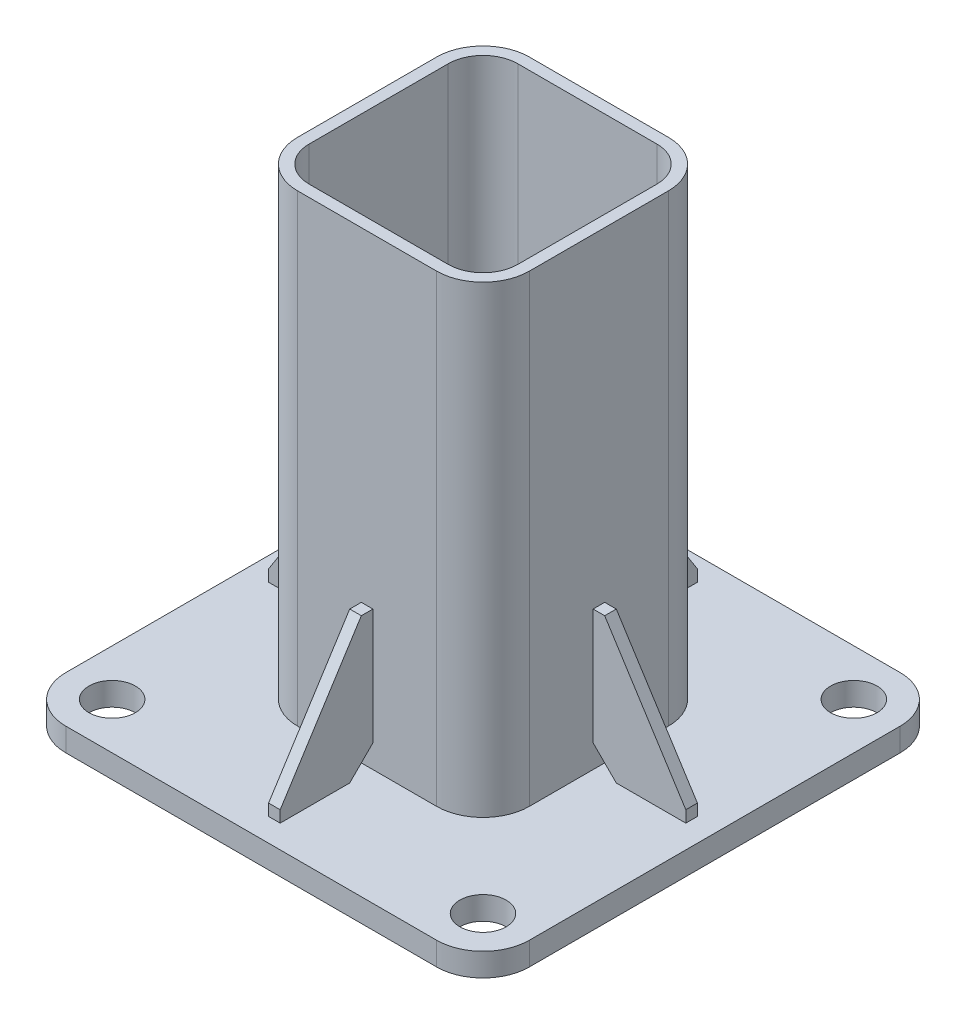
ISO-10303-21;
HEADER;
FILE_DESCRIPTION(('STEP AP214'),'2;1');
FILE_NAME('part.step','',(''),(''),'','','');
FILE_SCHEMA(('AUTOMOTIVE_DESIGN { 1 0 10303 214 1 1 1 1 }'));
ENDSEC;
DATA;
#1=APPLICATION_CONTEXT('core data for automotive mechanical design processes');
#2=APPLICATION_PROTOCOL_DEFINITION('international standard','automotive_design',2000,#1);
#3=PRODUCT_CONTEXT('',#1,'mechanical');
#4=PRODUCT('Part','Part','',(#3));
#5=PRODUCT_RELATED_PRODUCT_CATEGORY('part','',(#4));
#6=PRODUCT_DEFINITION_FORMATION('','',#4);
#7=PRODUCT_DEFINITION_CONTEXT('part definition',#1,'design');
#8=PRODUCT_DEFINITION('design','',#6,#7);
#9=PRODUCT_DEFINITION_SHAPE('','',#8);
#10=(LENGTH_UNIT() NAMED_UNIT(*) SI_UNIT(.MILLI.,.METRE.));
#11=(NAMED_UNIT(*) PLANE_ANGLE_UNIT() SI_UNIT($,.RADIAN.));
#12=(NAMED_UNIT(*) SI_UNIT($,.STERADIAN.) SOLID_ANGLE_UNIT());
#13=UNCERTAINTY_MEASURE_WITH_UNIT(LENGTH_MEASURE(1.E-05),#10,'distance_accuracy_value','');
#14=(GEOMETRIC_REPRESENTATION_CONTEXT(3) GLOBAL_UNCERTAINTY_ASSIGNED_CONTEXT((#13)) GLOBAL_UNIT_ASSIGNED_CONTEXT((#10,
#11,#12)) REPRESENTATION_CONTEXT('',''));
#15=CARTESIAN_POINT('',(0.,0.,0.));
#16=DIRECTION('',(0.,0.,1.));
#17=DIRECTION('',(1.,0.,0.));
#18=AXIS2_PLACEMENT_3D('',#15,#16,#17);
#19=CARTESIAN_POINT('',(50.,70.,-2.49999999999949));
#20=DIRECTION('',(0.,-1.,0.));
#21=DIRECTION('',(-1.,0.,0.));
#22=AXIS2_PLACEMENT_3D('',#19,#20,#21);
#23=PLANE('',#22);
#24=DIRECTION('',(1.,0.,0.));
#25=VECTOR('',#24,1.);
#26=CARTESIAN_POINT('',(50.,70.,2.50000000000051));
#27=LINE('',#26,#25);
#28=CARTESIAN_POINT('',(50.,70.,2.50000000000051));
#29=VERTEX_POINT('',#28);
#30=CARTESIAN_POINT('',(55.,70.,2.50000000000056));
#31=VERTEX_POINT('',#30);
#32=EDGE_CURVE('E186',#29,#31,#27,.T.);
#33=ORIENTED_EDGE('',*,*,#32,.T.);
#34=DIRECTION('',(0.,0.,1.));
#35=VECTOR('',#34,1.);
#36=CARTESIAN_POINT('',(55.,70.,-2.49999999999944));
#37=LINE('',#36,#35);
#38=CARTESIAN_POINT('',(55.,70.,-2.49999999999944));
#39=VERTEX_POINT('',#38);
#40=EDGE_CURVE('E13',#39,#31,#37,.T.);
#41=ORIENTED_EDGE('',*,*,#40,.F.);
#42=DIRECTION('',(1.,0.,0.));
#43=VECTOR('',#42,1.);
#44=CARTESIAN_POINT('',(50.,70.,-2.49999999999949));
#45=LINE('',#44,#43);
#46=CARTESIAN_POINT('',(50.,70.,-2.49999999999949));
#47=VERTEX_POINT('',#46);
#48=EDGE_CURVE('E196',#47,#39,#45,.T.);
#49=ORIENTED_EDGE('',*,*,#48,.F.);
#50=DIRECTION('',(0.,0.,1.));
#51=VECTOR('',#50,1.);
#52=CARTESIAN_POINT('',(50.,70.,-2.49999999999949));
#53=LINE('',#52,#51);
#54=EDGE_CURVE('E182',#47,#29,#53,.T.);
#55=ORIENTED_EDGE('',*,*,#54,.T.);
#56=EDGE_LOOP('',(#33,#41,#49,#55));
#57=FACE_BOUND('',#56,.T.);
#58=ADVANCED_FACE('F102',(#57),#23,.F.);
#59=CARTESIAN_POINT('',(55.,70.,-2.49999999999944));
#60=DIRECTION('',(-0.843661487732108,-0.536875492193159,0.));
#61=DIRECTION('',(-0.536875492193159,0.843661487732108,0.));
#62=AXIS2_PLACEMENT_3D('',#59,#60,#61);
#63=PLANE('',#62);
#64=DIRECTION('',(0.536875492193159,-0.843661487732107,0.));
#65=VECTOR('',#64,1.);
#66=CARTESIAN_POINT('',(55.,70.,2.50000000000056));
#67=LINE('',#66,#65);
#68=CARTESIAN_POINT('',(90.,15.,2.50000000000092));
#69=VERTEX_POINT('',#68);
#70=EDGE_CURVE('E189',#31,#69,#67,.T.);
#71=ORIENTED_EDGE('',*,*,#70,.T.);
#72=DIRECTION('',(0.,0.,1.));
#73=VECTOR('',#72,1.);
#74=CARTESIAN_POINT('',(90.,15.,-2.49999999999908));
#75=LINE('',#74,#73);
#76=CARTESIAN_POINT('',(90.,15.,-2.49999999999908));
#77=VERTEX_POINT('',#76);
#78=EDGE_CURVE('E110',#77,#69,#75,.T.);
#79=ORIENTED_EDGE('',*,*,#78,.F.);
#80=DIRECTION('',(0.536875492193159,-0.843661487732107,0.));
#81=VECTOR('',#80,1.);
#82=CARTESIAN_POINT('',(55.,70.,-2.49999999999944));
#83=LINE('',#82,#81);
#84=EDGE_CURVE('E155',#39,#77,#83,.T.);
#85=ORIENTED_EDGE('',*,*,#84,.F.);
#86=ORIENTED_EDGE('',*,*,#40,.T.);
#87=EDGE_LOOP('',(#71,#79,#85,#86));
#88=FACE_BOUND('',#87,.T.);
#89=ADVANCED_FACE('F220',(#88),#63,.F.);
#90=CARTESIAN_POINT('',(90.,10.,-2.49999999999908));
#91=DIRECTION('',(-1.,0.,0.));
#92=DIRECTION('',(0.,0.,1.));
#93=AXIS2_PLACEMENT_3D('',#90,#91,#92);
#94=PLANE('',#93);
#95=DIRECTION('',(0.,-1.,0.));
#96=VECTOR('',#95,1.);
#97=CARTESIAN_POINT('',(90.,10.,2.50000000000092));
#98=LINE('',#97,#96);
#99=CARTESIAN_POINT('',(90.,10.,2.50000000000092));
#100=VERTEX_POINT('',#99);
#101=EDGE_CURVE('E191',#69,#100,#98,.T.);
#102=ORIENTED_EDGE('',*,*,#101,.T.);
#103=DIRECTION('',(0.,0.,1.));
#104=VECTOR('',#103,1.);
#105=CARTESIAN_POINT('',(90.,10.,-2.49999999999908));
#106=LINE('',#105,#104);
#107=CARTESIAN_POINT('',(90.,10.,-2.49999999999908));
#108=VERTEX_POINT('',#107);
#109=EDGE_CURVE('E177',#108,#100,#106,.T.);
#110=ORIENTED_EDGE('',*,*,#109,.F.);
#111=DIRECTION('',(0.,-1.,0.));
#112=VECTOR('',#111,1.);
#113=CARTESIAN_POINT('',(90.,10.,-2.49999999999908));
#114=LINE('',#113,#112);
#115=EDGE_CURVE('E168',#77,#108,#114,.T.);
#116=ORIENTED_EDGE('',*,*,#115,.F.);
#117=ORIENTED_EDGE('',*,*,#78,.T.);
#118=EDGE_LOOP('',(#102,#110,#116,#117));
#119=FACE_BOUND('',#118,.T.);
#120=ADVANCED_FACE('F202',(#119),#94,.F.);
#121=CARTESIAN_POINT('',(60.,10.,-2.49999999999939));
#122=DIRECTION('',(0.,1.,0.));
#123=DIRECTION('',(1.,0.,0.));
#124=AXIS2_PLACEMENT_3D('',#121,#122,#123);
#125=PLANE('',#124);
#126=DIRECTION('',(-1.,0.,0.));
#127=VECTOR('',#126,1.);
#128=CARTESIAN_POINT('',(60.,10.,2.50000000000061));
#129=LINE('',#128,#127);
#130=CARTESIAN_POINT('',(60.,10.,2.50000000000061));
#131=VERTEX_POINT('',#130);
#132=EDGE_CURVE('E176',#100,#131,#129,.T.);
#133=ORIENTED_EDGE('',*,*,#132,.T.);
#134=DIRECTION('',(0.,0.,1.));
#135=VECTOR('',#134,1.);
#136=CARTESIAN_POINT('',(60.,10.,-2.49999999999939));
#137=LINE('',#136,#135);
#138=CARTESIAN_POINT('',(60.,10.,-2.49999999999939));
#139=VERTEX_POINT('',#138);
#140=EDGE_CURVE('E173',#139,#131,#137,.T.);
#141=ORIENTED_EDGE('',*,*,#140,.F.);
#142=DIRECTION('',(-1.,0.,0.));
#143=VECTOR('',#142,1.);
#144=CARTESIAN_POINT('',(60.,10.,-2.49999999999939));
#145=LINE('',#144,#143);
#146=EDGE_CURVE('E162',#108,#139,#145,.T.);
#147=ORIENTED_EDGE('',*,*,#146,.F.);
#148=ORIENTED_EDGE('',*,*,#109,.T.);
#149=EDGE_LOOP('',(#133,#141,#147,#148));
#150=FACE_BOUND('',#149,.T.);
#151=ADVANCED_FACE('F174',(#150),#125,.F.);
#152=CARTESIAN_POINT('',(50.,20.,-2.49999999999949));
#153=DIRECTION('',(0.707106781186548,0.707106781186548,0.));
#154=DIRECTION('',(0.707106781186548,-0.707106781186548,0.));
#155=AXIS2_PLACEMENT_3D('',#152,#153,#154);
#156=PLANE('',#155);
#157=DIRECTION('',(-0.707106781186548,0.707106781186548,0.));
#158=VECTOR('',#157,1.);
#159=CARTESIAN_POINT('',(50.,20.,2.50000000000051));
#160=LINE('',#159,#158);
#161=CARTESIAN_POINT('',(50.,20.,2.50000000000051));
#162=VERTEX_POINT('',#161);
#163=EDGE_CURVE('E141',#131,#162,#160,.T.);
#164=ORIENTED_EDGE('',*,*,#163,.T.);
#165=DIRECTION('',(0.,0.,1.));
#166=VECTOR('',#165,1.);
#167=CARTESIAN_POINT('',(50.,20.,-2.49999999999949));
#168=LINE('',#167,#166);
#169=CARTESIAN_POINT('',(50.,20.,-2.49999999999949));
#170=VERTEX_POINT('',#169);
#171=EDGE_CURVE('E178',#170,#162,#168,.T.);
#172=ORIENTED_EDGE('',*,*,#171,.F.);
#173=DIRECTION('',(-0.707106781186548,0.707106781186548,0.));
#174=VECTOR('',#173,1.);
#175=CARTESIAN_POINT('',(50.,20.,-2.49999999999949));
#176=LINE('',#175,#174);
#177=EDGE_CURVE('E166',#139,#170,#176,.T.);
#178=ORIENTED_EDGE('',*,*,#177,.F.);
#179=ORIENTED_EDGE('',*,*,#140,.T.);
#180=EDGE_LOOP('',(#164,#172,#178,#179));
#181=FACE_BOUND('',#180,.T.);
#182=ADVANCED_FACE('F180',(#181),#156,.F.);
#183=CARTESIAN_POINT('',(50.,20.,-2.49999999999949));
#184=DIRECTION('',(1.,0.,0.));
#185=DIRECTION('',(0.,0.,-1.));
#186=AXIS2_PLACEMENT_3D('',#183,#184,#185);
#187=PLANE('',#186);
#188=DIRECTION('',(0.,1.,0.));
#189=VECTOR('',#188,1.);
#190=CARTESIAN_POINT('',(50.,20.,2.50000000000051));
#191=LINE('',#190,#189);
#192=EDGE_CURVE('E147',#162,#29,#191,.T.);
#193=ORIENTED_EDGE('',*,*,#192,.T.);
#194=ORIENTED_EDGE('',*,*,#54,.F.);
#195=DIRECTION('',(0.,1.,0.));
#196=VECTOR('',#195,1.);
#197=CARTESIAN_POINT('',(50.,20.,-2.49999999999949));
#198=LINE('',#197,#196);
#199=EDGE_CURVE('E118',#170,#47,#198,.T.);
#200=ORIENTED_EDGE('',*,*,#199,.F.);
#201=ORIENTED_EDGE('',*,*,#171,.T.);
#202=EDGE_LOOP('',(#193,#194,#200,#201));
#203=FACE_BOUND('',#202,.T.);
#204=ADVANCED_FACE('F209',(#203),#187,.F.);
#205=CARTESIAN_POINT('',(0.,0.,-2.50000000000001));
#206=DIRECTION('',(0.,0.,1.));
#207=DIRECTION('',(1.,0.,0.));
#208=AXIS2_PLACEMENT_3D('',#205,#206,#207);
#209=PLANE('',#208);
#210=ORIENTED_EDGE('',*,*,#48,.T.);
#211=ORIENTED_EDGE('',*,*,#84,.T.);
#212=ORIENTED_EDGE('',*,*,#115,.T.);
#213=ORIENTED_EDGE('',*,*,#146,.T.);
#214=ORIENTED_EDGE('',*,*,#177,.T.);
#215=ORIENTED_EDGE('',*,*,#199,.T.);
#216=EDGE_LOOP('',(#210,#211,#212,#213,#214,#215));
#217=FACE_BOUND('',#216,.T.);
#218=ADVANCED_FACE('F164',(#217),#209,.F.);
#219=CARTESIAN_POINT('',(0.,0.,2.49999999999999));
#220=DIRECTION('',(0.,0.,1.));
#221=DIRECTION('',(1.,0.,0.));
#222=AXIS2_PLACEMENT_3D('',#219,#220,#221);
#223=PLANE('',#222);
#224=ORIENTED_EDGE('',*,*,#32,.F.);
#225=ORIENTED_EDGE('',*,*,#192,.F.);
#226=ORIENTED_EDGE('',*,*,#163,.F.);
#227=ORIENTED_EDGE('',*,*,#132,.F.);
#228=ORIENTED_EDGE('',*,*,#101,.F.);
#229=ORIENTED_EDGE('',*,*,#70,.F.);
#230=EDGE_LOOP('',(#224,#225,#226,#227,#228,#229));
#231=FACE_BOUND('',#230,.T.);
#232=ADVANCED_FACE('F205',(#231),#223,.T.);
#233=CLOSED_SHELL('',(#58,#89,#120,#151,#182,#204,#218,#232));
#234=MANIFOLD_SOLID_BREP('B2',#233);
#235=CARTESIAN_POINT('',(-2.50000000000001,70.,-50.));
#236=DIRECTION('',(0.,-1.,0.));
#237=DIRECTION('',(0.,0.,1.));
#238=AXIS2_PLACEMENT_3D('',#235,#236,#237);
#239=PLANE('',#238);
#240=DIRECTION('',(0.,0.,-1.));
#241=VECTOR('',#240,1.);
#242=CARTESIAN_POINT('',(2.49999999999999,70.,-50.));
#243=LINE('',#242,#241);
#244=CARTESIAN_POINT('',(2.49999999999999,70.,-50.));
#245=VERTEX_POINT('',#244);
#246=CARTESIAN_POINT('',(2.49999999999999,70.,-55.));
#247=VERTEX_POINT('',#246);
#248=EDGE_CURVE('E371',#245,#247,#243,.T.);
#249=ORIENTED_EDGE('',*,*,#248,.T.);
#250=DIRECTION('',(1.,0.,0.));
#251=VECTOR('',#250,1.);
#252=CARTESIAN_POINT('',(-2.50000000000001,70.,-55.));
#253=LINE('',#252,#251);
#254=CARTESIAN_POINT('',(-2.50000000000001,70.,-55.));
#255=VERTEX_POINT('',#254);
#256=EDGE_CURVE('E100',#255,#247,#253,.T.);
#257=ORIENTED_EDGE('',*,*,#256,.F.);
#258=DIRECTION('',(0.,0.,-1.));
#259=VECTOR('',#258,1.);
#260=CARTESIAN_POINT('',(-2.50000000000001,70.,-50.));
#261=LINE('',#260,#259);
#262=CARTESIAN_POINT('',(-2.50000000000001,70.,-50.));
#263=VERTEX_POINT('',#262);
#264=EDGE_CURVE('E381',#263,#255,#261,.T.);
#265=ORIENTED_EDGE('',*,*,#264,.F.);
#266=DIRECTION('',(1.,0.,0.));
#267=VECTOR('',#266,1.);
#268=CARTESIAN_POINT('',(-2.50000000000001,70.,-50.));
#269=LINE('',#268,#267);
#270=EDGE_CURVE('E367',#263,#245,#269,.T.);
#271=ORIENTED_EDGE('',*,*,#270,.T.);
#272=EDGE_LOOP('',(#249,#257,#265,#271));
#273=FACE_BOUND('',#272,.T.);
#274=ADVANCED_FACE('F287',(#273),#239,.F.);
#275=CARTESIAN_POINT('',(-2.50000000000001,70.,-55.));
#276=DIRECTION('',(0.,-0.536875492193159,0.843661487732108));
#277=DIRECTION('',(0.,0.843661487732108,0.536875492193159));
#278=AXIS2_PLACEMENT_3D('',#275,#276,#277);
#279=PLANE('',#278);
#280=DIRECTION('',(0.,-0.843661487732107,-0.536875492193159));
#281=VECTOR('',#280,1.);
#282=CARTESIAN_POINT('',(2.49999999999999,70.,-55.));
#283=LINE('',#282,#281);
#284=CARTESIAN_POINT('',(2.49999999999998,15.,-90.));
#285=VERTEX_POINT('',#284);
#286=EDGE_CURVE('E374',#247,#285,#283,.T.);
#287=ORIENTED_EDGE('',*,*,#286,.T.);
#288=DIRECTION('',(1.,0.,0.));
#289=VECTOR('',#288,1.);
#290=CARTESIAN_POINT('',(-2.50000000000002,15.,-90.));
#291=LINE('',#290,#289);
#292=CARTESIAN_POINT('',(-2.50000000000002,15.,-90.));
#293=VERTEX_POINT('',#292);
#294=EDGE_CURVE('E295',#293,#285,#291,.T.);
#295=ORIENTED_EDGE('',*,*,#294,.F.);
#296=DIRECTION('',(0.,-0.843661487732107,-0.536875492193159));
#297=VECTOR('',#296,1.);
#298=CARTESIAN_POINT('',(-2.50000000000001,70.,-55.));
#299=LINE('',#298,#297);
#300=EDGE_CURVE('E340',#255,#293,#299,.T.);
#301=ORIENTED_EDGE('',*,*,#300,.F.);
#302=ORIENTED_EDGE('',*,*,#256,.T.);
#303=EDGE_LOOP('',(#287,#295,#301,#302));
#304=FACE_BOUND('',#303,.T.);
#305=ADVANCED_FACE('F405',(#304),#279,.F.);
#306=CARTESIAN_POINT('',(-2.50000000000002,10.,-90.));
#307=DIRECTION('',(0.,0.,1.));
#308=DIRECTION('',(1.,0.,0.));
#309=AXIS2_PLACEMENT_3D('',#306,#307,#308);
#310=PLANE('',#309);
#311=DIRECTION('',(0.,-1.,0.));
#312=VECTOR('',#311,1.);
#313=CARTESIAN_POINT('',(2.49999999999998,10.,-90.));
#314=LINE('',#313,#312);
#315=CARTESIAN_POINT('',(2.49999999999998,10.,-90.));
#316=VERTEX_POINT('',#315);
#317=EDGE_CURVE('E376',#285,#316,#314,.T.);
#318=ORIENTED_EDGE('',*,*,#317,.T.);
#319=DIRECTION('',(1.,0.,0.));
#320=VECTOR('',#319,1.);
#321=CARTESIAN_POINT('',(-2.50000000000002,10.,-90.));
#322=LINE('',#321,#320);
#323=CARTESIAN_POINT('',(-2.50000000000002,10.,-90.));
#324=VERTEX_POINT('',#323);
#325=EDGE_CURVE('E362',#324,#316,#322,.T.);
#326=ORIENTED_EDGE('',*,*,#325,.F.);
#327=DIRECTION('',(0.,-1.,0.));
#328=VECTOR('',#327,1.);
#329=CARTESIAN_POINT('',(-2.50000000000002,10.,-90.));
#330=LINE('',#329,#328);
#331=EDGE_CURVE('E353',#293,#324,#330,.T.);
#332=ORIENTED_EDGE('',*,*,#331,.F.);
#333=ORIENTED_EDGE('',*,*,#294,.T.);
#334=EDGE_LOOP('',(#318,#326,#332,#333));
#335=FACE_BOUND('',#334,.T.);
#336=ADVANCED_FACE('F387',(#335),#310,.F.);
#337=CARTESIAN_POINT('',(-2.50000000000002,10.,-60.));
#338=DIRECTION('',(0.,1.,0.));
#339=DIRECTION('',(0.,0.,-1.));
#340=AXIS2_PLACEMENT_3D('',#337,#338,#339);
#341=PLANE('',#340);
#342=DIRECTION('',(0.,0.,1.));
#343=VECTOR('',#342,1.);
#344=CARTESIAN_POINT('',(2.49999999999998,10.,-60.));
#345=LINE('',#344,#343);
#346=CARTESIAN_POINT('',(2.49999999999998,10.,-60.));
#347=VERTEX_POINT('',#346);
#348=EDGE_CURVE('E361',#316,#347,#345,.T.);
#349=ORIENTED_EDGE('',*,*,#348,.T.);
#350=DIRECTION('',(1.,0.,0.));
#351=VECTOR('',#350,1.);
#352=CARTESIAN_POINT('',(-2.50000000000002,10.,-60.));
#353=LINE('',#352,#351);
#354=CARTESIAN_POINT('',(-2.50000000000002,10.,-60.));
#355=VERTEX_POINT('',#354);
#356=EDGE_CURVE('E358',#355,#347,#353,.T.);
#357=ORIENTED_EDGE('',*,*,#356,.F.);
#358=DIRECTION('',(0.,0.,1.));
#359=VECTOR('',#358,1.);
#360=CARTESIAN_POINT('',(-2.50000000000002,10.,-60.));
#361=LINE('',#360,#359);
#362=EDGE_CURVE('E347',#324,#355,#361,.T.);
#363=ORIENTED_EDGE('',*,*,#362,.F.);
#364=ORIENTED_EDGE('',*,*,#325,.T.);
#365=EDGE_LOOP('',(#349,#357,#363,#364));
#366=FACE_BOUND('',#365,.T.);
#367=ADVANCED_FACE('F359',(#366),#341,.F.);
#368=CARTESIAN_POINT('',(-2.50000000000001,20.,-50.));
#369=DIRECTION('',(0.,0.707106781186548,-0.707106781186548));
#370=DIRECTION('',(0.,-0.707106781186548,-0.707106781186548));
#371=AXIS2_PLACEMENT_3D('',#368,#369,#370);
#372=PLANE('',#371);
#373=DIRECTION('',(0.,0.707106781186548,0.707106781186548));
#374=VECTOR('',#373,1.);
#375=CARTESIAN_POINT('',(2.49999999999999,20.,-50.));
#376=LINE('',#375,#374);
#377=CARTESIAN_POINT('',(2.49999999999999,20.,-50.));
#378=VERTEX_POINT('',#377);
#379=EDGE_CURVE('E326',#347,#378,#376,.T.);
#380=ORIENTED_EDGE('',*,*,#379,.T.);
#381=DIRECTION('',(1.,0.,0.));
#382=VECTOR('',#381,1.);
#383=CARTESIAN_POINT('',(-2.50000000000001,20.,-50.));
#384=LINE('',#383,#382);
#385=CARTESIAN_POINT('',(-2.50000000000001,20.,-50.));
#386=VERTEX_POINT('',#385);
#387=EDGE_CURVE('E363',#386,#378,#384,.T.);
#388=ORIENTED_EDGE('',*,*,#387,.F.);
#389=DIRECTION('',(0.,0.707106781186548,0.707106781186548));
#390=VECTOR('',#389,1.);
#391=CARTESIAN_POINT('',(-2.50000000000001,20.,-50.));
#392=LINE('',#391,#390);
#393=EDGE_CURVE('E351',#355,#386,#392,.T.);
#394=ORIENTED_EDGE('',*,*,#393,.F.);
#395=ORIENTED_EDGE('',*,*,#356,.T.);
#396=EDGE_LOOP('',(#380,#388,#394,#395));
#397=FACE_BOUND('',#396,.T.);
#398=ADVANCED_FACE('F365',(#397),#372,.F.);
#399=CARTESIAN_POINT('',(-2.50000000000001,20.,-50.));
#400=DIRECTION('',(0.,0.,-1.));
#401=DIRECTION('',(-1.,0.,0.));
#402=AXIS2_PLACEMENT_3D('',#399,#400,#401);
#403=PLANE('',#402);
#404=DIRECTION('',(0.,1.,0.));
#405=VECTOR('',#404,1.);
#406=CARTESIAN_POINT('',(2.49999999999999,20.,-50.));
#407=LINE('',#406,#405);
#408=EDGE_CURVE('E332',#378,#245,#407,.T.);
#409=ORIENTED_EDGE('',*,*,#408,.T.);
#410=ORIENTED_EDGE('',*,*,#270,.F.);
#411=DIRECTION('',(0.,1.,0.));
#412=VECTOR('',#411,1.);
#413=CARTESIAN_POINT('',(-2.50000000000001,20.,-50.));
#414=LINE('',#413,#412);
#415=EDGE_CURVE('E303',#386,#263,#414,.T.);
#416=ORIENTED_EDGE('',*,*,#415,.F.);
#417=ORIENTED_EDGE('',*,*,#387,.T.);
#418=EDGE_LOOP('',(#409,#410,#416,#417));
#419=FACE_BOUND('',#418,.T.);
#420=ADVANCED_FACE('F394',(#419),#403,.F.);
#421=CARTESIAN_POINT('',(-2.50000000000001,0.,0.));
#422=DIRECTION('',(1.,0.,0.));
#423=DIRECTION('',(0.,0.,-1.));
#424=AXIS2_PLACEMENT_3D('',#421,#422,#423);
#425=PLANE('',#424);
#426=ORIENTED_EDGE('',*,*,#264,.T.);
#427=ORIENTED_EDGE('',*,*,#300,.T.);
#428=ORIENTED_EDGE('',*,*,#331,.T.);
#429=ORIENTED_EDGE('',*,*,#362,.T.);
#430=ORIENTED_EDGE('',*,*,#393,.T.);
#431=ORIENTED_EDGE('',*,*,#415,.T.);
#432=EDGE_LOOP('',(#426,#427,#428,#429,#430,#431));
#433=FACE_BOUND('',#432,.T.);
#434=ADVANCED_FACE('F349',(#433),#425,.F.);
#435=CARTESIAN_POINT('',(2.49999999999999,0.,0.));
#436=DIRECTION('',(1.,0.,0.));
#437=DIRECTION('',(0.,0.,-1.));
#438=AXIS2_PLACEMENT_3D('',#435,#436,#437);
#439=PLANE('',#438);
#440=ORIENTED_EDGE('',*,*,#248,.F.);
#441=ORIENTED_EDGE('',*,*,#408,.F.);
#442=ORIENTED_EDGE('',*,*,#379,.F.);
#443=ORIENTED_EDGE('',*,*,#348,.F.);
#444=ORIENTED_EDGE('',*,*,#317,.F.);
#445=ORIENTED_EDGE('',*,*,#286,.F.);
#446=EDGE_LOOP('',(#440,#441,#442,#443,#444,#445));
#447=FACE_BOUND('',#446,.T.);
#448=ADVANCED_FACE('F390',(#447),#439,.T.);
#449=CLOSED_SHELL('',(#274,#305,#336,#367,#398,#420,#434,#448));
#450=MANIFOLD_SOLID_BREP('B7',#449);
#451=CARTESIAN_POINT('',(-50.,70.,2.49999999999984));
#452=DIRECTION('',(0.,-1.,0.));
#453=DIRECTION('',(1.,0.,0.));
#454=AXIS2_PLACEMENT_3D('',#451,#452,#453);
#455=PLANE('',#454);
#456=DIRECTION('',(-1.,0.,0.));
#457=VECTOR('',#456,1.);
#458=CARTESIAN_POINT('',(-50.,70.,-2.50000000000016));
#459=LINE('',#458,#457);
#460=CARTESIAN_POINT('',(-50.,70.,-2.50000000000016));
#461=VERTEX_POINT('',#460);
#462=CARTESIAN_POINT('',(-55.,70.,-2.50000000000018));
#463=VERTEX_POINT('',#462);
#464=EDGE_CURVE('E556',#461,#463,#459,.T.);
#465=ORIENTED_EDGE('',*,*,#464,.T.);
#466=DIRECTION('',(0.,0.,-1.));
#467=VECTOR('',#466,1.);
#468=CARTESIAN_POINT('',(-55.,70.,2.49999999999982));
#469=LINE('',#468,#467);
#470=CARTESIAN_POINT('',(-55.,70.,2.49999999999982));
#471=VERTEX_POINT('',#470);
#472=EDGE_CURVE('E285',#471,#463,#469,.T.);
#473=ORIENTED_EDGE('',*,*,#472,.F.);
#474=DIRECTION('',(-1.,0.,0.));
#475=VECTOR('',#474,1.);
#476=CARTESIAN_POINT('',(-50.,70.,2.49999999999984));
#477=LINE('',#476,#475);
#478=CARTESIAN_POINT('',(-50.,70.,2.49999999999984));
#479=VERTEX_POINT('',#478);
#480=EDGE_CURVE('E566',#479,#471,#477,.T.);
#481=ORIENTED_EDGE('',*,*,#480,.F.);
#482=DIRECTION('',(0.,0.,-1.));
#483=VECTOR('',#482,1.);
#484=CARTESIAN_POINT('',(-50.,70.,2.49999999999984));
#485=LINE('',#484,#483);
#486=EDGE_CURVE('E552',#479,#461,#485,.T.);
#487=ORIENTED_EDGE('',*,*,#486,.T.);
#488=EDGE_LOOP('',(#465,#473,#481,#487));
#489=FACE_BOUND('',#488,.T.);
#490=ADVANCED_FACE('F472',(#489),#455,.F.);
#491=CARTESIAN_POINT('',(-55.,70.,2.49999999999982));
#492=DIRECTION('',(0.843661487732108,-0.536875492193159,0.));
#493=DIRECTION('',(0.536875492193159,0.843661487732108,0.));
#494=AXIS2_PLACEMENT_3D('',#491,#492,#493);
#495=PLANE('',#494);
#496=DIRECTION('',(-0.536875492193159,-0.843661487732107,0.));
#497=VECTOR('',#496,1.);
#498=CARTESIAN_POINT('',(-55.,70.,-2.50000000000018));
#499=LINE('',#498,#497);
#500=CARTESIAN_POINT('',(-90.,15.,-2.5000000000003));
#501=VERTEX_POINT('',#500);
#502=EDGE_CURVE('E559',#463,#501,#499,.T.);
#503=ORIENTED_EDGE('',*,*,#502,.T.);
#504=DIRECTION('',(0.,0.,-1.));
#505=VECTOR('',#504,1.);
#506=CARTESIAN_POINT('',(-90.,15.,2.4999999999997));
#507=LINE('',#506,#505);
#508=CARTESIAN_POINT('',(-90.,15.,2.4999999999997));
#509=VERTEX_POINT('',#508);
#510=EDGE_CURVE('E480',#509,#501,#507,.T.);
#511=ORIENTED_EDGE('',*,*,#510,.F.);
#512=DIRECTION('',(-0.536875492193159,-0.843661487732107,0.));
#513=VECTOR('',#512,1.);
#514=CARTESIAN_POINT('',(-55.,70.,2.49999999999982));
#515=LINE('',#514,#513);
#516=EDGE_CURVE('E525',#471,#509,#515,.T.);
#517=ORIENTED_EDGE('',*,*,#516,.F.);
#518=ORIENTED_EDGE('',*,*,#472,.T.);
#519=EDGE_LOOP('',(#503,#511,#517,#518));
#520=FACE_BOUND('',#519,.T.);
#521=ADVANCED_FACE('F590',(#520),#495,.F.);
#522=CARTESIAN_POINT('',(-90.,10.,2.4999999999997));
#523=DIRECTION('',(1.,0.,0.));
#524=DIRECTION('',(0.,0.,-1.));
#525=AXIS2_PLACEMENT_3D('',#522,#523,#524);
#526=PLANE('',#525);
#527=DIRECTION('',(0.,-1.,0.));
#528=VECTOR('',#527,1.);
#529=CARTESIAN_POINT('',(-90.,10.,-2.5000000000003));
#530=LINE('',#529,#528);
#531=CARTESIAN_POINT('',(-90.,10.,-2.5000000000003));
#532=VERTEX_POINT('',#531);
#533=EDGE_CURVE('E561',#501,#532,#530,.T.);
#534=ORIENTED_EDGE('',*,*,#533,.T.);
#535=DIRECTION('',(0.,0.,-1.));
#536=VECTOR('',#535,1.);
#537=CARTESIAN_POINT('',(-90.,10.,2.4999999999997));
#538=LINE('',#537,#536);
#539=CARTESIAN_POINT('',(-90.,10.,2.4999999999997));
#540=VERTEX_POINT('',#539);
#541=EDGE_CURVE('E547',#540,#532,#538,.T.);
#542=ORIENTED_EDGE('',*,*,#541,.F.);
#543=DIRECTION('',(0.,-1.,0.));
#544=VECTOR('',#543,1.);
#545=CARTESIAN_POINT('',(-90.,10.,2.4999999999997));
#546=LINE('',#545,#544);
#547=EDGE_CURVE('E538',#509,#540,#546,.T.);
#548=ORIENTED_EDGE('',*,*,#547,.F.);
#549=ORIENTED_EDGE('',*,*,#510,.T.);
#550=EDGE_LOOP('',(#534,#542,#548,#549));
#551=FACE_BOUND('',#550,.T.);
#552=ADVANCED_FACE('F572',(#551),#526,.F.);
#553=CARTESIAN_POINT('',(-60.,10.,2.49999999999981));
#554=DIRECTION('',(0.,1.,0.));
#555=DIRECTION('',(-1.,0.,0.));
#556=AXIS2_PLACEMENT_3D('',#553,#554,#555);
#557=PLANE('',#556);
#558=DIRECTION('',(1.,0.,0.));
#559=VECTOR('',#558,1.);
#560=CARTESIAN_POINT('',(-60.,10.,-2.50000000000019));
#561=LINE('',#560,#559);
#562=CARTESIAN_POINT('',(-60.,10.,-2.50000000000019));
#563=VERTEX_POINT('',#562);
#564=EDGE_CURVE('E546',#532,#563,#561,.T.);
#565=ORIENTED_EDGE('',*,*,#564,.T.);
#566=DIRECTION('',(0.,0.,-1.));
#567=VECTOR('',#566,1.);
#568=CARTESIAN_POINT('',(-60.,10.,2.49999999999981));
#569=LINE('',#568,#567);
#570=CARTESIAN_POINT('',(-60.,10.,2.49999999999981));
#571=VERTEX_POINT('',#570);
#572=EDGE_CURVE('E543',#571,#563,#569,.T.);
#573=ORIENTED_EDGE('',*,*,#572,.F.);
#574=DIRECTION('',(1.,0.,0.));
#575=VECTOR('',#574,1.);
#576=CARTESIAN_POINT('',(-60.,10.,2.49999999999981));
#577=LINE('',#576,#575);
#578=EDGE_CURVE('E532',#540,#571,#577,.T.);
#579=ORIENTED_EDGE('',*,*,#578,.F.);
#580=ORIENTED_EDGE('',*,*,#541,.T.);
#581=EDGE_LOOP('',(#565,#573,#579,#580));
#582=FACE_BOUND('',#581,.T.);
#583=ADVANCED_FACE('F544',(#582),#557,.F.);
#584=CARTESIAN_POINT('',(-50.,20.,2.49999999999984));
#585=DIRECTION('',(-0.707106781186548,0.707106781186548,0.));
#586=DIRECTION('',(-0.707106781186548,-0.707106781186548,0.));
#587=AXIS2_PLACEMENT_3D('',#584,#585,#586);
#588=PLANE('',#587);
#589=DIRECTION('',(0.707106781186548,0.707106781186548,0.));
#590=VECTOR('',#589,1.);
#591=CARTESIAN_POINT('',(-50.,20.,-2.50000000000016));
#592=LINE('',#591,#590);
#593=CARTESIAN_POINT('',(-50.,20.,-2.50000000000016));
#594=VERTEX_POINT('',#593);
#595=EDGE_CURVE('E511',#563,#594,#592,.T.);
#596=ORIENTED_EDGE('',*,*,#595,.T.);
#597=DIRECTION('',(0.,0.,-1.));
#598=VECTOR('',#597,1.);
#599=CARTESIAN_POINT('',(-50.,20.,2.49999999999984));
#600=LINE('',#599,#598);
#601=CARTESIAN_POINT('',(-50.,20.,2.49999999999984));
#602=VERTEX_POINT('',#601);
#603=EDGE_CURVE('E548',#602,#594,#600,.T.);
#604=ORIENTED_EDGE('',*,*,#603,.F.);
#605=DIRECTION('',(0.707106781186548,0.707106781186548,0.));
#606=VECTOR('',#605,1.);
#607=CARTESIAN_POINT('',(-50.,20.,2.49999999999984));
#608=LINE('',#607,#606);
#609=EDGE_CURVE('E536',#571,#602,#608,.T.);
#610=ORIENTED_EDGE('',*,*,#609,.F.);
#611=ORIENTED_EDGE('',*,*,#572,.T.);
#612=EDGE_LOOP('',(#596,#604,#610,#611));
#613=FACE_BOUND('',#612,.T.);
#614=ADVANCED_FACE('F550',(#613),#588,.F.);
#615=CARTESIAN_POINT('',(-50.,20.,2.49999999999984));
#616=DIRECTION('',(-1.,0.,0.));
#617=DIRECTION('',(0.,0.,1.));
#618=AXIS2_PLACEMENT_3D('',#615,#616,#617);
#619=PLANE('',#618);
#620=DIRECTION('',(0.,1.,0.));
#621=VECTOR('',#620,1.);
#622=CARTESIAN_POINT('',(-50.,20.,-2.50000000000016));
#623=LINE('',#622,#621);
#624=EDGE_CURVE('E517',#594,#461,#623,.T.);
#625=ORIENTED_EDGE('',*,*,#624,.T.);
#626=ORIENTED_EDGE('',*,*,#486,.F.);
#627=DIRECTION('',(0.,1.,0.));
#628=VECTOR('',#627,1.);
#629=CARTESIAN_POINT('',(-50.,20.,2.49999999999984));
#630=LINE('',#629,#628);
#631=EDGE_CURVE('E488',#602,#479,#630,.T.);
#632=ORIENTED_EDGE('',*,*,#631,.F.);
#633=ORIENTED_EDGE('',*,*,#603,.T.);
#634=EDGE_LOOP('',(#625,#626,#632,#633));
#635=FACE_BOUND('',#634,.T.);
#636=ADVANCED_FACE('F579',(#635),#619,.F.);
#637=CARTESIAN_POINT('',(0.,0.,2.50000000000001));
#638=DIRECTION('',(0.,0.,-1.));
#639=DIRECTION('',(-1.,0.,0.));
#640=AXIS2_PLACEMENT_3D('',#637,#638,#639);
#641=PLANE('',#640);
#642=ORIENTED_EDGE('',*,*,#480,.T.);
#643=ORIENTED_EDGE('',*,*,#516,.T.);
#644=ORIENTED_EDGE('',*,*,#547,.T.);
#645=ORIENTED_EDGE('',*,*,#578,.T.);
#646=ORIENTED_EDGE('',*,*,#609,.T.);
#647=ORIENTED_EDGE('',*,*,#631,.T.);
#648=EDGE_LOOP('',(#642,#643,#644,#645,#646,#647));
#649=FACE_BOUND('',#648,.T.);
#650=ADVANCED_FACE('F534',(#649),#641,.F.);
#651=CARTESIAN_POINT('',(0.,0.,-2.49999999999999));
#652=DIRECTION('',(0.,0.,-1.));
#653=DIRECTION('',(-1.,0.,0.));
#654=AXIS2_PLACEMENT_3D('',#651,#652,#653);
#655=PLANE('',#654);
#656=ORIENTED_EDGE('',*,*,#464,.F.);
#657=ORIENTED_EDGE('',*,*,#624,.F.);
#658=ORIENTED_EDGE('',*,*,#595,.F.);
#659=ORIENTED_EDGE('',*,*,#564,.F.);
#660=ORIENTED_EDGE('',*,*,#533,.F.);
#661=ORIENTED_EDGE('',*,*,#502,.F.);
#662=EDGE_LOOP('',(#656,#657,#658,#659,#660,#661));
#663=FACE_BOUND('',#662,.T.);
#664=ADVANCED_FACE('F575',(#663),#655,.T.);
#665=CLOSED_SHELL('',(#490,#521,#552,#583,#614,#636,#650,#664));
#666=MANIFOLD_SOLID_BREP('B94',#665);
#667=CARTESIAN_POINT('',(2.50000000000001,70.,50.));
#668=DIRECTION('',(0.,-1.,0.));
#669=DIRECTION('',(0.,0.,-1.));
#670=AXIS2_PLACEMENT_3D('',#667,#668,#669);
#671=PLANE('',#670);
#672=DIRECTION('',(0.,0.,1.));
#673=VECTOR('',#672,1.);
#674=CARTESIAN_POINT('',(-2.49999999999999,70.,50.));
#675=LINE('',#674,#673);
#676=CARTESIAN_POINT('',(-2.49999999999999,70.,50.));
#677=VERTEX_POINT('',#676);
#678=CARTESIAN_POINT('',(-2.49999999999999,70.,55.));
#679=VERTEX_POINT('',#678);
#680=EDGE_CURVE('E741',#677,#679,#675,.T.);
#681=ORIENTED_EDGE('',*,*,#680,.T.);
#682=DIRECTION('',(-1.,0.,0.));
#683=VECTOR('',#682,1.);
#684=CARTESIAN_POINT('',(2.50000000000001,70.,55.));
#685=LINE('',#684,#683);
#686=CARTESIAN_POINT('',(2.50000000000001,70.,55.));
#687=VERTEX_POINT('',#686);
#688=EDGE_CURVE('E470',#687,#679,#685,.T.);
#689=ORIENTED_EDGE('',*,*,#688,.F.);
#690=DIRECTION('',(0.,0.,1.));
#691=VECTOR('',#690,1.);
#692=CARTESIAN_POINT('',(2.50000000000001,70.,50.));
#693=LINE('',#692,#691);
#694=CARTESIAN_POINT('',(2.50000000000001,70.,50.));
#695=VERTEX_POINT('',#694);
#696=EDGE_CURVE('E751',#695,#687,#693,.T.);
#697=ORIENTED_EDGE('',*,*,#696,.F.);
#698=DIRECTION('',(-1.,0.,0.));
#699=VECTOR('',#698,1.);
#700=CARTESIAN_POINT('',(2.50000000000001,70.,50.));
#701=LINE('',#700,#699);
#702=EDGE_CURVE('E737',#695,#677,#701,.T.);
#703=ORIENTED_EDGE('',*,*,#702,.T.);
#704=EDGE_LOOP('',(#681,#689,#697,#703));
#705=FACE_BOUND('',#704,.T.);
#706=ADVANCED_FACE('F657',(#705),#671,.F.);
#707=CARTESIAN_POINT('',(2.50000000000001,70.,55.));
#708=DIRECTION('',(0.,-0.536875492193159,-0.843661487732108));
#709=DIRECTION('',(0.,0.843661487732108,-0.536875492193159));
#710=AXIS2_PLACEMENT_3D('',#707,#708,#709);
#711=PLANE('',#710);
#712=DIRECTION('',(0.,-0.843661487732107,0.536875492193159));
#713=VECTOR('',#712,1.);
#714=CARTESIAN_POINT('',(-2.49999999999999,70.,55.));
#715=LINE('',#714,#713);
#716=CARTESIAN_POINT('',(-2.49999999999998,15.,90.));
#717=VERTEX_POINT('',#716);
#718=EDGE_CURVE('E744',#679,#717,#715,.T.);
#719=ORIENTED_EDGE('',*,*,#718,.T.);
#720=DIRECTION('',(-1.,0.,0.));
#721=VECTOR('',#720,1.);
#722=CARTESIAN_POINT('',(2.50000000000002,15.,90.));
#723=LINE('',#722,#721);
#724=CARTESIAN_POINT('',(2.50000000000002,15.,90.));
#725=VERTEX_POINT('',#724);
#726=EDGE_CURVE('E665',#725,#717,#723,.T.);
#727=ORIENTED_EDGE('',*,*,#726,.F.);
#728=DIRECTION('',(0.,-0.843661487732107,0.536875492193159));
#729=VECTOR('',#728,1.);
#730=CARTESIAN_POINT('',(2.50000000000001,70.,55.));
#731=LINE('',#730,#729);
#732=EDGE_CURVE('E710',#687,#725,#731,.T.);
#733=ORIENTED_EDGE('',*,*,#732,.F.);
#734=ORIENTED_EDGE('',*,*,#688,.T.);
#735=EDGE_LOOP('',(#719,#727,#733,#734));
#736=FACE_BOUND('',#735,.T.);
#737=ADVANCED_FACE('F775',(#736),#711,.F.);
#738=CARTESIAN_POINT('',(2.50000000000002,10.,90.));
#739=DIRECTION('',(0.,0.,-1.));
#740=DIRECTION('',(-1.,0.,0.));
#741=AXIS2_PLACEMENT_3D('',#738,#739,#740);
#742=PLANE('',#741);
#743=DIRECTION('',(0.,-1.,0.));
#744=VECTOR('',#743,1.);
#745=CARTESIAN_POINT('',(-2.49999999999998,10.,90.));
#746=LINE('',#745,#744);
#747=CARTESIAN_POINT('',(-2.49999999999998,10.,90.));
#748=VERTEX_POINT('',#747);
#749=EDGE_CURVE('E746',#717,#748,#746,.T.);
#750=ORIENTED_EDGE('',*,*,#749,.T.);
#751=DIRECTION('',(-1.,0.,0.));
#752=VECTOR('',#751,1.);
#753=CARTESIAN_POINT('',(2.50000000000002,10.,90.));
#754=LINE('',#753,#752);
#755=CARTESIAN_POINT('',(2.50000000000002,10.,90.));
#756=VERTEX_POINT('',#755);
#757=EDGE_CURVE('E732',#756,#748,#754,.T.);
#758=ORIENTED_EDGE('',*,*,#757,.F.);
#759=DIRECTION('',(0.,-1.,0.));
#760=VECTOR('',#759,1.);
#761=CARTESIAN_POINT('',(2.50000000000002,10.,90.));
#762=LINE('',#761,#760);
#763=EDGE_CURVE('E723',#725,#756,#762,.T.);
#764=ORIENTED_EDGE('',*,*,#763,.F.);
#765=ORIENTED_EDGE('',*,*,#726,.T.);
#766=EDGE_LOOP('',(#750,#758,#764,#765));
#767=FACE_BOUND('',#766,.T.);
#768=ADVANCED_FACE('F757',(#767),#742,.F.);
#769=CARTESIAN_POINT('',(2.50000000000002,10.,60.));
#770=DIRECTION('',(0.,1.,0.));
#771=DIRECTION('',(0.,0.,1.));
#772=AXIS2_PLACEMENT_3D('',#769,#770,#771);
#773=PLANE('',#772);
#774=DIRECTION('',(0.,0.,-1.));
#775=VECTOR('',#774,1.);
#776=CARTESIAN_POINT('',(-2.49999999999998,10.,60.));
#777=LINE('',#776,#775);
#778=CARTESIAN_POINT('',(-2.49999999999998,10.,60.));
#779=VERTEX_POINT('',#778);
#780=EDGE_CURVE('E731',#748,#779,#777,.T.);
#781=ORIENTED_EDGE('',*,*,#780,.T.);
#782=DIRECTION('',(-1.,0.,0.));
#783=VECTOR('',#782,1.);
#784=CARTESIAN_POINT('',(2.50000000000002,10.,60.));
#785=LINE('',#784,#783);
#786=CARTESIAN_POINT('',(2.50000000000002,10.,60.));
#787=VERTEX_POINT('',#786);
#788=EDGE_CURVE('E728',#787,#779,#785,.T.);
#789=ORIENTED_EDGE('',*,*,#788,.F.);
#790=DIRECTION('',(0.,0.,-1.));
#791=VECTOR('',#790,1.);
#792=CARTESIAN_POINT('',(2.50000000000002,10.,60.));
#793=LINE('',#792,#791);
#794=EDGE_CURVE('E717',#756,#787,#793,.T.);
#795=ORIENTED_EDGE('',*,*,#794,.F.);
#796=ORIENTED_EDGE('',*,*,#757,.T.);
#797=EDGE_LOOP('',(#781,#789,#795,#796));
#798=FACE_BOUND('',#797,.T.);
#799=ADVANCED_FACE('F729',(#798),#773,.F.);
#800=CARTESIAN_POINT('',(2.50000000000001,20.,50.));
#801=DIRECTION('',(0.,0.707106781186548,0.707106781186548));
#802=DIRECTION('',(0.,-0.707106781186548,0.707106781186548));
#803=AXIS2_PLACEMENT_3D('',#800,#801,#802);
#804=PLANE('',#803);
#805=DIRECTION('',(0.,0.707106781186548,-0.707106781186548));
#806=VECTOR('',#805,1.);
#807=CARTESIAN_POINT('',(-2.49999999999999,20.,50.));
#808=LINE('',#807,#806);
#809=CARTESIAN_POINT('',(-2.49999999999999,20.,50.));
#810=VERTEX_POINT('',#809);
#811=EDGE_CURVE('E696',#779,#810,#808,.T.);
#812=ORIENTED_EDGE('',*,*,#811,.T.);
#813=DIRECTION('',(-1.,0.,0.));
#814=VECTOR('',#813,1.);
#815=CARTESIAN_POINT('',(2.50000000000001,20.,50.));
#816=LINE('',#815,#814);
#817=CARTESIAN_POINT('',(2.50000000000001,20.,50.));
#818=VERTEX_POINT('',#817);
#819=EDGE_CURVE('E733',#818,#810,#816,.T.);
#820=ORIENTED_EDGE('',*,*,#819,.F.);
#821=DIRECTION('',(0.,0.707106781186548,-0.707106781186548));
#822=VECTOR('',#821,1.);
#823=CARTESIAN_POINT('',(2.50000000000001,20.,50.));
#824=LINE('',#823,#822);
#825=EDGE_CURVE('E721',#787,#818,#824,.T.);
#826=ORIENTED_EDGE('',*,*,#825,.F.);
#827=ORIENTED_EDGE('',*,*,#788,.T.);
#828=EDGE_LOOP('',(#812,#820,#826,#827));
#829=FACE_BOUND('',#828,.T.);
#830=ADVANCED_FACE('F735',(#829),#804,.F.);
#831=CARTESIAN_POINT('',(2.50000000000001,20.,50.));
#832=DIRECTION('',(0.,0.,1.));
#833=DIRECTION('',(1.,0.,0.));
#834=AXIS2_PLACEMENT_3D('',#831,#832,#833);
#835=PLANE('',#834);
#836=DIRECTION('',(0.,1.,0.));
#837=VECTOR('',#836,1.);
#838=CARTESIAN_POINT('',(-2.49999999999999,20.,50.));
#839=LINE('',#838,#837);
#840=EDGE_CURVE('E702',#810,#677,#839,.T.);
#841=ORIENTED_EDGE('',*,*,#840,.T.);
#842=ORIENTED_EDGE('',*,*,#702,.F.);
#843=DIRECTION('',(0.,1.,0.));
#844=VECTOR('',#843,1.);
#845=CARTESIAN_POINT('',(2.50000000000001,20.,50.));
#846=LINE('',#845,#844);
#847=EDGE_CURVE('E673',#818,#695,#846,.T.);
#848=ORIENTED_EDGE('',*,*,#847,.F.);
#849=ORIENTED_EDGE('',*,*,#819,.T.);
#850=EDGE_LOOP('',(#841,#842,#848,#849));
#851=FACE_BOUND('',#850,.T.);
#852=ADVANCED_FACE('F764',(#851),#835,.F.);
#853=CARTESIAN_POINT('',(2.50000000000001,0.,0.));
#854=DIRECTION('',(-1.,0.,0.));
#855=DIRECTION('',(0.,0.,1.));
#856=AXIS2_PLACEMENT_3D('',#853,#854,#855);
#857=PLANE('',#856);
#858=ORIENTED_EDGE('',*,*,#696,.T.);
#859=ORIENTED_EDGE('',*,*,#732,.T.);
#860=ORIENTED_EDGE('',*,*,#763,.T.);
#861=ORIENTED_EDGE('',*,*,#794,.T.);
#862=ORIENTED_EDGE('',*,*,#825,.T.);
#863=ORIENTED_EDGE('',*,*,#847,.T.);
#864=EDGE_LOOP('',(#858,#859,#860,#861,#862,#863));
#865=FACE_BOUND('',#864,.T.);
#866=ADVANCED_FACE('F719',(#865),#857,.F.);
#867=CARTESIAN_POINT('',(-2.49999999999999,0.,0.));
#868=DIRECTION('',(-1.,0.,0.));
#869=DIRECTION('',(0.,0.,1.));
#870=AXIS2_PLACEMENT_3D('',#867,#868,#869);
#871=PLANE('',#870);
#872=ORIENTED_EDGE('',*,*,#680,.F.);
#873=ORIENTED_EDGE('',*,*,#840,.F.);
#874=ORIENTED_EDGE('',*,*,#811,.F.);
#875=ORIENTED_EDGE('',*,*,#780,.F.);
#876=ORIENTED_EDGE('',*,*,#749,.F.);
#877=ORIENTED_EDGE('',*,*,#718,.F.);
#878=EDGE_LOOP('',(#872,#873,#874,#875,#876,#877));
#879=FACE_BOUND('',#878,.T.);
#880=ADVANCED_FACE('F760',(#879),#871,.T.);
#881=CLOSED_SHELL('',(#706,#737,#768,#799,#830,#852,#866,#880));
#882=MANIFOLD_SOLID_BREP('B279',#881);
#883=CARTESIAN_POINT('',(-30.,210.,-30.));
#884=DIRECTION('',(0.,1.,0.));
#885=DIRECTION('',(0.,0.,1.));
#886=AXIS2_PLACEMENT_3D('',#883,#884,#885);
#887=PLANE('',#886);
#888=CARTESIAN_POINT('',(-30.,210.,-30.));
#889=DIRECTION('',(0.,1.,0.));
#890=DIRECTION('',(0.,0.,1.));
#891=AXIS2_PLACEMENT_3D('',#888,#889,#890);
#892=CIRCLE('',#891,20.);
#893=CARTESIAN_POINT('',(-29.9999999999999,210.,-50.));
#894=VERTEX_POINT('',#893);
#895=CARTESIAN_POINT('',(-50.,210.,-29.9999999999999));
#896=VERTEX_POINT('',#895);
#897=EDGE_CURVE('E1019',#894,#896,#892,.T.);
#898=ORIENTED_EDGE('',*,*,#897,.T.);
#899=DIRECTION('',(0.,0.,1.));
#900=VECTOR('',#899,1.);
#901=CARTESIAN_POINT('',(-50.,210.,-29.9999999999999));
#902=LINE('',#901,#900);
#903=CARTESIAN_POINT('',(-50.,210.,29.9999999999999));
#904=VERTEX_POINT('',#903);
#905=EDGE_CURVE('E1022',#896,#904,#902,.T.);
#906=ORIENTED_EDGE('',*,*,#905,.T.);
#907=CARTESIAN_POINT('',(-30.,210.,30.));
#908=DIRECTION('',(0.,1.,0.));
#909=DIRECTION('',(0.,0.,1.));
#910=AXIS2_PLACEMENT_3D('',#907,#908,#909);
#911=CIRCLE('',#910,20.);
#912=CARTESIAN_POINT('',(-29.9999999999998,210.,50.));
#913=VERTEX_POINT('',#912);
#914=EDGE_CURVE('E1025',#904,#913,#911,.T.);
#915=ORIENTED_EDGE('',*,*,#914,.T.);
#916=DIRECTION('',(1.,0.,0.));
#917=VECTOR('',#916,1.);
#918=CARTESIAN_POINT('',(-29.9999999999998,210.,50.));
#919=LINE('',#918,#917);
#920=CARTESIAN_POINT('',(29.9999999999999,210.,50.));
#921=VERTEX_POINT('',#920);
#922=EDGE_CURVE('E1027',#913,#921,#919,.T.);
#923=ORIENTED_EDGE('',*,*,#922,.T.);
#924=CARTESIAN_POINT('',(30.,210.,30.));
#925=DIRECTION('',(0.,1.,0.));
#926=DIRECTION('',(0.,0.,1.));
#927=AXIS2_PLACEMENT_3D('',#924,#925,#926);
#928=CIRCLE('',#927,20.);
#929=CARTESIAN_POINT('',(50.,210.,29.9999999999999));
#930=VERTEX_POINT('',#929);
#931=EDGE_CURVE('E1029',#921,#930,#928,.T.);
#932=ORIENTED_EDGE('',*,*,#931,.T.);
#933=DIRECTION('',(0.,0.,-1.));
#934=VECTOR('',#933,1.);
#935=CARTESIAN_POINT('',(50.,210.,-29.9999999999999));
#936=LINE('',#935,#934);
#937=CARTESIAN_POINT('',(50.,210.,-29.9999999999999));
#938=VERTEX_POINT('',#937);
#939=EDGE_CURVE('E1031',#930,#938,#936,.T.);
#940=ORIENTED_EDGE('',*,*,#939,.T.);
#941=CARTESIAN_POINT('',(30.,210.,-30.));
#942=DIRECTION('',(0.,1.,0.));
#943=DIRECTION('',(0.,0.,-1.));
#944=AXIS2_PLACEMENT_3D('',#941,#942,#943);
#945=CIRCLE('',#944,20.);
#946=CARTESIAN_POINT('',(29.9999999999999,210.,-50.));
#947=VERTEX_POINT('',#946);
#948=EDGE_CURVE('E1033',#938,#947,#945,.T.);
#949=ORIENTED_EDGE('',*,*,#948,.T.);
#950=DIRECTION('',(-1.,0.,0.));
#951=VECTOR('',#950,1.);
#952=CARTESIAN_POINT('',(-29.9999999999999,210.,-50.));
#953=LINE('',#952,#951);
#954=EDGE_CURVE('E1035',#947,#894,#953,.T.);
#955=ORIENTED_EDGE('',*,*,#954,.T.);
#956=EDGE_LOOP('',(#898,#906,#915,#923,#932,#940,#949,#955));
#957=FACE_BOUND('',#956,.T.);
#958=DIRECTION('',(0.,0.,1.));
#959=VECTOR('',#958,1.);
#960=CARTESIAN_POINT('',(-45.,210.,-29.9999999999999));
#961=LINE('',#960,#959);
#962=CARTESIAN_POINT('',(-45.,210.,-29.9999999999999));
#963=VERTEX_POINT('',#962);
#964=CARTESIAN_POINT('',(-45.,210.,29.9999999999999));
#965=VERTEX_POINT('',#964);
#966=EDGE_CURVE('E962',#963,#965,#961,.T.);
#967=ORIENTED_EDGE('',*,*,#966,.F.);
#968=CARTESIAN_POINT('',(-30.,210.,-30.));
#969=DIRECTION('',(0.,1.,0.));
#970=DIRECTION('',(1.,0.,0.));
#971=AXIS2_PLACEMENT_3D('',#968,#969,#970);
#972=CIRCLE('',#971,15.);
#973=CARTESIAN_POINT('',(-29.9999999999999,210.,-45.));
#974=VERTEX_POINT('',#973);
#975=EDGE_CURVE('E954',#974,#963,#972,.T.);
#976=ORIENTED_EDGE('',*,*,#975,.F.);
#977=DIRECTION('',(-1.,0.,0.));
#978=VECTOR('',#977,1.);
#979=CARTESIAN_POINT('',(-29.9999999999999,210.,-45.));
#980=LINE('',#979,#978);
#981=CARTESIAN_POINT('',(29.9999999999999,210.,-45.));
#982=VERTEX_POINT('',#981);
#983=EDGE_CURVE('E987',#982,#974,#980,.T.);
#984=ORIENTED_EDGE('',*,*,#983,.F.);
#985=CARTESIAN_POINT('',(30.,210.,-30.));
#986=DIRECTION('',(0.,1.,0.));
#987=DIRECTION('',(1.,0.,0.));
#988=AXIS2_PLACEMENT_3D('',#985,#986,#987);
#989=CIRCLE('',#988,15.);
#990=CARTESIAN_POINT('',(45.,210.,-29.9999999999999));
#991=VERTEX_POINT('',#990);
#992=EDGE_CURVE('E985',#991,#982,#989,.T.);
#993=ORIENTED_EDGE('',*,*,#992,.F.);
#994=DIRECTION('',(0.,0.,-1.));
#995=VECTOR('',#994,1.);
#996=CARTESIAN_POINT('',(45.,210.,-29.9999999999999));
#997=LINE('',#996,#995);
#998=CARTESIAN_POINT('',(45.,210.,29.9999999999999));
#999=VERTEX_POINT('',#998);
#1000=EDGE_CURVE('E983',#999,#991,#997,.T.);
#1001=ORIENTED_EDGE('',*,*,#1000,.F.);
#1002=CARTESIAN_POINT('',(30.,210.,30.));
#1003=DIRECTION('',(0.,1.,0.));
#1004=DIRECTION('',(1.,0.,0.));
#1005=AXIS2_PLACEMENT_3D('',#1002,#1003,#1004);
#1006=CIRCLE('',#1005,15.);
#1007=CARTESIAN_POINT('',(29.9999999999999,210.,45.));
#1008=VERTEX_POINT('',#1007);
#1009=EDGE_CURVE('E981',#1008,#999,#1006,.T.);
#1010=ORIENTED_EDGE('',*,*,#1009,.F.);
#1011=DIRECTION('',(1.,0.,0.));
#1012=VECTOR('',#1011,1.);
#1013=CARTESIAN_POINT('',(-29.9999999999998,210.,45.));
#1014=LINE('',#1013,#1012);
#1015=CARTESIAN_POINT('',(-29.9999999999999,210.,45.));
#1016=VERTEX_POINT('',#1015);
#1017=EDGE_CURVE('E977',#1016,#1008,#1014,.T.);
#1018=ORIENTED_EDGE('',*,*,#1017,.F.);
#1019=CARTESIAN_POINT('',(-30.,210.,30.));
#1020=DIRECTION('',(0.,1.,0.));
#1021=DIRECTION('',(1.,0.,0.));
#1022=AXIS2_PLACEMENT_3D('',#1019,#1020,#1021);
#1023=CIRCLE('',#1022,15.);
#1024=EDGE_CURVE('E975',#965,#1016,#1023,.T.);
#1025=ORIENTED_EDGE('',*,*,#1024,.F.);
#1026=EDGE_LOOP('',(#967,#976,#984,#993,#1001,#1010,#1018,#1025));
#1027=FACE_BOUND('',#1026,.T.);
#1028=ADVANCED_FACE('F841',(#957,#1027),#887,.T.);
#1029=CARTESIAN_POINT('',(-30.,10.,-30.));
#1030=DIRECTION('',(0.,1.,0.));
#1031=DIRECTION('',(0.,0.,1.));
#1032=AXIS2_PLACEMENT_3D('',#1029,#1030,#1031);
#1033=PLANE('',#1032);
#1034=CARTESIAN_POINT('',(-30.,10.,-30.));
#1035=DIRECTION('',(0.,1.,0.));
#1036=DIRECTION('',(0.,0.,1.));
#1037=AXIS2_PLACEMENT_3D('',#1034,#1035,#1036);
#1038=CIRCLE('',#1037,20.);
#1039=CARTESIAN_POINT('',(-29.9999999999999,10.,-50.));
#1040=VERTEX_POINT('',#1039);
#1041=CARTESIAN_POINT('',(-50.,10.,-29.9999999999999));
#1042=VERTEX_POINT('',#1041);
#1043=EDGE_CURVE('E970',#1040,#1042,#1038,.T.);
#1044=ORIENTED_EDGE('',*,*,#1043,.F.);
#1045=DIRECTION('',(-1.,0.,0.));
#1046=VECTOR('',#1045,1.);
#1047=CARTESIAN_POINT('',(-29.9999999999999,10.,-50.));
#1048=LINE('',#1047,#1046);
#1049=CARTESIAN_POINT('',(29.9999999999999,10.,-50.));
#1050=VERTEX_POINT('',#1049);
#1051=EDGE_CURVE('E1023',#1050,#1040,#1048,.T.);
#1052=ORIENTED_EDGE('',*,*,#1051,.F.);
#1053=CARTESIAN_POINT('',(30.,10.,-30.));
#1054=DIRECTION('',(0.,1.,0.));
#1055=DIRECTION('',(0.,0.,-1.));
#1056=AXIS2_PLACEMENT_3D('',#1053,#1054,#1055);
#1057=CIRCLE('',#1056,20.);
#1058=CARTESIAN_POINT('',(50.,10.,-29.9999999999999));
#1059=VERTEX_POINT('',#1058);
#1060=EDGE_CURVE('E1050',#1059,#1050,#1057,.T.);
#1061=ORIENTED_EDGE('',*,*,#1060,.F.);
#1062=DIRECTION('',(0.,0.,-1.));
#1063=VECTOR('',#1062,1.);
#1064=CARTESIAN_POINT('',(50.,10.,-29.9999999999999));
#1065=LINE('',#1064,#1063);
#1066=CARTESIAN_POINT('',(50.,10.,29.9999999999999));
#1067=VERTEX_POINT('',#1066);
#1068=EDGE_CURVE('E1048',#1067,#1059,#1065,.T.);
#1069=ORIENTED_EDGE('',*,*,#1068,.F.);
#1070=CARTESIAN_POINT('',(30.,10.,30.));
#1071=DIRECTION('',(0.,1.,0.));
#1072=DIRECTION('',(0.,0.,1.));
#1073=AXIS2_PLACEMENT_3D('',#1070,#1071,#1072);
#1074=CIRCLE('',#1073,20.);
#1075=CARTESIAN_POINT('',(29.9999999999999,10.,50.));
#1076=VERTEX_POINT('',#1075);
#1077=EDGE_CURVE('E1046',#1076,#1067,#1074,.T.);
#1078=ORIENTED_EDGE('',*,*,#1077,.F.);
#1079=DIRECTION('',(1.,0.,0.));
#1080=VECTOR('',#1079,1.);
#1081=CARTESIAN_POINT('',(-29.9999999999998,10.,50.));
#1082=LINE('',#1081,#1080);
#1083=CARTESIAN_POINT('',(-29.9999999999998,10.,50.));
#1084=VERTEX_POINT('',#1083);
#1085=EDGE_CURVE('E1044',#1084,#1076,#1082,.T.);
#1086=ORIENTED_EDGE('',*,*,#1085,.F.);
#1087=CARTESIAN_POINT('',(-30.,10.,30.));
#1088=DIRECTION('',(0.,1.,0.));
#1089=DIRECTION('',(0.,0.,1.));
#1090=AXIS2_PLACEMENT_3D('',#1087,#1088,#1089);
#1091=CIRCLE('',#1090,20.);
#1092=CARTESIAN_POINT('',(-50.,10.,29.9999999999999));
#1093=VERTEX_POINT('',#1092);
#1094=EDGE_CURVE('E1042',#1093,#1084,#1091,.T.);
#1095=ORIENTED_EDGE('',*,*,#1094,.F.);
#1096=DIRECTION('',(0.,0.,1.));
#1097=VECTOR('',#1096,1.);
#1098=CARTESIAN_POINT('',(-50.,10.,-29.9999999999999));
#1099=LINE('',#1098,#1097);
#1100=EDGE_CURVE('E1040',#1042,#1093,#1099,.T.);
#1101=ORIENTED_EDGE('',*,*,#1100,.F.);
#1102=EDGE_LOOP('',(#1044,#1052,#1061,#1069,#1078,#1086,#1095,#1101));
#1103=FACE_BOUND('',#1102,.T.);
#1104=CARTESIAN_POINT('',(-30.,10.,-30.));
#1105=DIRECTION('',(0.,1.,0.));
#1106=DIRECTION('',(1.,0.,0.));
#1107=AXIS2_PLACEMENT_3D('',#1104,#1105,#1106);
#1108=CIRCLE('',#1107,15.);
#1109=CARTESIAN_POINT('',(-29.9999999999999,10.,-45.));
#1110=VERTEX_POINT('',#1109);
#1111=CARTESIAN_POINT('',(-45.,10.,-29.9999999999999));
#1112=VERTEX_POINT('',#1111);
#1113=EDGE_CURVE('E864',#1110,#1112,#1108,.T.);
#1114=ORIENTED_EDGE('',*,*,#1113,.T.);
#1115=DIRECTION('',(0.,0.,1.));
#1116=VECTOR('',#1115,1.);
#1117=CARTESIAN_POINT('',(-45.,10.,-29.9999999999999));
#1118=LINE('',#1117,#1116);
#1119=CARTESIAN_POINT('',(-45.,10.,29.9999999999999));
#1120=VERTEX_POINT('',#1119);
#1121=EDGE_CURVE('E969',#1112,#1120,#1118,.T.);
#1122=ORIENTED_EDGE('',*,*,#1121,.T.);
#1123=CARTESIAN_POINT('',(-30.,10.,30.));
#1124=DIRECTION('',(0.,1.,0.));
#1125=DIRECTION('',(1.,0.,0.));
#1126=AXIS2_PLACEMENT_3D('',#1123,#1124,#1125);
#1127=CIRCLE('',#1126,15.);
#1128=CARTESIAN_POINT('',(-29.9999999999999,10.,45.));
#1129=VERTEX_POINT('',#1128);
#1130=EDGE_CURVE('E991',#1120,#1129,#1127,.T.);
#1131=ORIENTED_EDGE('',*,*,#1130,.T.);
#1132=DIRECTION('',(1.,0.,0.));
#1133=VECTOR('',#1132,1.);
#1134=CARTESIAN_POINT('',(-29.9999999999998,10.,45.));
#1135=LINE('',#1134,#1133);
#1136=CARTESIAN_POINT('',(29.9999999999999,10.,45.));
#1137=VERTEX_POINT('',#1136);
#1138=EDGE_CURVE('E994',#1129,#1137,#1135,.T.);
#1139=ORIENTED_EDGE('',*,*,#1138,.T.);
#1140=CARTESIAN_POINT('',(30.,10.,30.));
#1141=DIRECTION('',(0.,1.,0.));
#1142=DIRECTION('',(1.,0.,0.));
#1143=AXIS2_PLACEMENT_3D('',#1140,#1141,#1142);
#1144=CIRCLE('',#1143,15.);
#1145=CARTESIAN_POINT('',(45.,10.,29.9999999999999));
#1146=VERTEX_POINT('',#1145);
#1147=EDGE_CURVE('E997',#1137,#1146,#1144,.T.);
#1148=ORIENTED_EDGE('',*,*,#1147,.T.);
#1149=DIRECTION('',(0.,0.,-1.));
#1150=VECTOR('',#1149,1.);
#1151=CARTESIAN_POINT('',(45.,10.,-29.9999999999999));
#1152=LINE('',#1151,#1150);
#1153=CARTESIAN_POINT('',(45.,10.,-29.9999999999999));
#1154=VERTEX_POINT('',#1153);
#1155=EDGE_CURVE('E1000',#1146,#1154,#1152,.T.);
#1156=ORIENTED_EDGE('',*,*,#1155,.T.);
#1157=CARTESIAN_POINT('',(30.,10.,-30.));
#1158=DIRECTION('',(0.,1.,0.));
#1159=DIRECTION('',(1.,0.,0.));
#1160=AXIS2_PLACEMENT_3D('',#1157,#1158,#1159);
#1161=CIRCLE('',#1160,15.);
#1162=CARTESIAN_POINT('',(29.9999999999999,10.,-45.));
#1163=VERTEX_POINT('',#1162);
#1164=EDGE_CURVE('E1003',#1154,#1163,#1161,.T.);
#1165=ORIENTED_EDGE('',*,*,#1164,.T.);
#1166=DIRECTION('',(-1.,0.,0.));
#1167=VECTOR('',#1166,1.);
#1168=CARTESIAN_POINT('',(-29.9999999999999,10.,-45.));
#1169=LINE('',#1168,#1167);
#1170=EDGE_CURVE('E963',#1163,#1110,#1169,.T.);
#1171=ORIENTED_EDGE('',*,*,#1170,.T.);
#1172=EDGE_LOOP('',(#1114,#1122,#1131,#1139,#1148,#1156,#1165,#1171));
#1173=FACE_BOUND('',#1172,.T.);
#1174=ADVANCED_FACE('F1080',(#1103,#1173),#1033,.F.);
#1175=CARTESIAN_POINT('',(-30.,210.,-30.));
#1176=DIRECTION('',(0.,-1.,0.));
#1177=DIRECTION('',(0.,0.,-1.));
#1178=AXIS2_PLACEMENT_3D('',#1175,#1176,#1177);
#1179=CYLINDRICAL_SURFACE('',#1178,20.);
#1180=ORIENTED_EDGE('',*,*,#1043,.T.);
#1181=DIRECTION('',(0.,-1.,0.));
#1182=VECTOR('',#1181,1.);
#1183=CARTESIAN_POINT('',(-50.,210.,-29.9999999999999));
#1184=LINE('',#1183,#1182);
#1185=EDGE_CURVE('E655',#896,#1042,#1184,.T.);
#1186=ORIENTED_EDGE('',*,*,#1185,.F.);
#1187=ORIENTED_EDGE('',*,*,#897,.F.);
#1188=DIRECTION('',(0.,-1.,0.));
#1189=VECTOR('',#1188,1.);
#1190=CARTESIAN_POINT('',(-29.9999999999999,210.,-50.));
#1191=LINE('',#1190,#1189);
#1192=EDGE_CURVE('E1037',#894,#1040,#1191,.T.);
#1193=ORIENTED_EDGE('',*,*,#1192,.T.);
#1194=EDGE_LOOP('',(#1180,#1186,#1187,#1193));
#1195=FACE_BOUND('',#1194,.T.);
#1196=ADVANCED_FACE('F843',(#1195),#1179,.T.);
#1197=CARTESIAN_POINT('',(-50.,210.,-29.9999999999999));
#1198=DIRECTION('',(1.,0.,0.));
#1199=DIRECTION('',(0.,0.,-1.));
#1200=AXIS2_PLACEMENT_3D('',#1197,#1198,#1199);
#1201=PLANE('',#1200);
#1202=ORIENTED_EDGE('',*,*,#1100,.T.);
#1203=DIRECTION('',(0.,-1.,0.));
#1204=VECTOR('',#1203,1.);
#1205=CARTESIAN_POINT('',(-50.,210.,29.9999999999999));
#1206=LINE('',#1205,#1204);
#1207=EDGE_CURVE('E849',#904,#1093,#1206,.T.);
#1208=ORIENTED_EDGE('',*,*,#1207,.F.);
#1209=ORIENTED_EDGE('',*,*,#905,.F.);
#1210=ORIENTED_EDGE('',*,*,#1185,.T.);
#1211=EDGE_LOOP('',(#1202,#1208,#1209,#1210));
#1212=FACE_BOUND('',#1211,.T.);
#1213=ADVANCED_FACE('F1097',(#1212),#1201,.F.);
#1214=CARTESIAN_POINT('',(-30.,210.,30.));
#1215=DIRECTION('',(0.,-1.,0.));
#1216=DIRECTION('',(0.,0.,-1.));
#1217=AXIS2_PLACEMENT_3D('',#1214,#1215,#1216);
#1218=CYLINDRICAL_SURFACE('',#1217,20.);
#1219=ORIENTED_EDGE('',*,*,#1094,.T.);
#1220=DIRECTION('',(0.,-1.,0.));
#1221=VECTOR('',#1220,1.);
#1222=CARTESIAN_POINT('',(-29.9999999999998,210.,50.));
#1223=LINE('',#1222,#1221);
#1224=EDGE_CURVE('E1067',#913,#1084,#1223,.T.);
#1225=ORIENTED_EDGE('',*,*,#1224,.F.);
#1226=ORIENTED_EDGE('',*,*,#914,.F.);
#1227=ORIENTED_EDGE('',*,*,#1207,.T.);
#1228=EDGE_LOOP('',(#1219,#1225,#1226,#1227));
#1229=FACE_BOUND('',#1228,.T.);
#1230=ADVANCED_FACE('F1074',(#1229),#1218,.T.);
#1231=CARTESIAN_POINT('',(-29.9999999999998,210.,50.));
#1232=DIRECTION('',(0.,0.,-1.));
#1233=DIRECTION('',(-1.,0.,0.));
#1234=AXIS2_PLACEMENT_3D('',#1231,#1232,#1233);
#1235=PLANE('',#1234);
#1236=ORIENTED_EDGE('',*,*,#1085,.T.);
#1237=DIRECTION('',(0.,-1.,0.));
#1238=VECTOR('',#1237,1.);
#1239=CARTESIAN_POINT('',(29.9999999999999,210.,50.));
#1240=LINE('',#1239,#1238);
#1241=EDGE_CURVE('E1064',#921,#1076,#1240,.T.);
#1242=ORIENTED_EDGE('',*,*,#1241,.F.);
#1243=ORIENTED_EDGE('',*,*,#922,.F.);
#1244=ORIENTED_EDGE('',*,*,#1224,.T.);
#1245=EDGE_LOOP('',(#1236,#1242,#1243,#1244));
#1246=FACE_BOUND('',#1245,.T.);
#1247=ADVANCED_FACE('F1086',(#1246),#1235,.F.);
#1248=CARTESIAN_POINT('',(30.,210.,30.));
#1249=DIRECTION('',(0.,-1.,0.));
#1250=DIRECTION('',(0.,0.,-1.));
#1251=AXIS2_PLACEMENT_3D('',#1248,#1249,#1250);
#1252=CYLINDRICAL_SURFACE('',#1251,20.);
#1253=ORIENTED_EDGE('',*,*,#1077,.T.);
#1254=DIRECTION('',(0.,-1.,0.));
#1255=VECTOR('',#1254,1.);
#1256=CARTESIAN_POINT('',(50.,210.,29.9999999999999));
#1257=LINE('',#1256,#1255);
#1258=EDGE_CURVE('E1061',#930,#1067,#1257,.T.);
#1259=ORIENTED_EDGE('',*,*,#1258,.F.);
#1260=ORIENTED_EDGE('',*,*,#931,.F.);
#1261=ORIENTED_EDGE('',*,*,#1241,.T.);
#1262=EDGE_LOOP('',(#1253,#1259,#1260,#1261));
#1263=FACE_BOUND('',#1262,.T.);
#1264=ADVANCED_FACE('F1090',(#1263),#1252,.T.);
#1265=CARTESIAN_POINT('',(50.,210.,-29.9999999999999));
#1266=DIRECTION('',(-1.,0.,0.));
#1267=DIRECTION('',(0.,0.,1.));
#1268=AXIS2_PLACEMENT_3D('',#1265,#1266,#1267);
#1269=PLANE('',#1268);
#1270=ORIENTED_EDGE('',*,*,#1068,.T.);
#1271=DIRECTION('',(0.,-1.,0.));
#1272=VECTOR('',#1271,1.);
#1273=CARTESIAN_POINT('',(50.,210.,-29.9999999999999));
#1274=LINE('',#1273,#1272);
#1275=EDGE_CURVE('E1058',#938,#1059,#1274,.T.);
#1276=ORIENTED_EDGE('',*,*,#1275,.F.);
#1277=ORIENTED_EDGE('',*,*,#939,.F.);
#1278=ORIENTED_EDGE('',*,*,#1258,.T.);
#1279=EDGE_LOOP('',(#1270,#1276,#1277,#1278));
#1280=FACE_BOUND('',#1279,.T.);
#1281=ADVANCED_FACE('F1110',(#1280),#1269,.F.);
#1282=CARTESIAN_POINT('',(30.,210.,-30.));
#1283=DIRECTION('',(0.,-1.,0.));
#1284=DIRECTION('',(0.,0.,-1.));
#1285=AXIS2_PLACEMENT_3D('',#1282,#1283,#1284);
#1286=CYLINDRICAL_SURFACE('',#1285,20.);
#1287=ORIENTED_EDGE('',*,*,#1060,.T.);
#1288=DIRECTION('',(0.,-1.,0.));
#1289=VECTOR('',#1288,1.);
#1290=CARTESIAN_POINT('',(29.9999999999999,210.,-50.));
#1291=LINE('',#1290,#1289);
#1292=EDGE_CURVE('E1055',#947,#1050,#1291,.T.);
#1293=ORIENTED_EDGE('',*,*,#1292,.F.);
#1294=ORIENTED_EDGE('',*,*,#948,.F.);
#1295=ORIENTED_EDGE('',*,*,#1275,.T.);
#1296=EDGE_LOOP('',(#1287,#1293,#1294,#1295));
#1297=FACE_BOUND('',#1296,.T.);
#1298=ADVANCED_FACE('F1108',(#1297),#1286,.T.);
#1299=CARTESIAN_POINT('',(-29.9999999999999,210.,-50.));
#1300=DIRECTION('',(0.,0.,1.));
#1301=DIRECTION('',(1.,0.,0.));
#1302=AXIS2_PLACEMENT_3D('',#1299,#1300,#1301);
#1303=PLANE('',#1302);
#1304=ORIENTED_EDGE('',*,*,#1051,.T.);
#1305=ORIENTED_EDGE('',*,*,#1192,.F.);
#1306=ORIENTED_EDGE('',*,*,#954,.F.);
#1307=ORIENTED_EDGE('',*,*,#1292,.T.);
#1308=EDGE_LOOP('',(#1304,#1305,#1306,#1307));
#1309=FACE_BOUND('',#1308,.T.);
#1310=ADVANCED_FACE('F1103',(#1309),#1303,.F.);
#1311=CARTESIAN_POINT('',(-30.,210.,-30.));
#1312=DIRECTION('',(0.,-1.,0.));
#1313=DIRECTION('',(0.,0.,-1.));
#1314=AXIS2_PLACEMENT_3D('',#1311,#1312,#1313);
#1315=CYLINDRICAL_SURFACE('',#1314,15.);
#1316=ORIENTED_EDGE('',*,*,#1113,.F.);
#1317=DIRECTION('',(0.,-1.,0.));
#1318=VECTOR('',#1317,1.);
#1319=CARTESIAN_POINT('',(-29.9999999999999,210.,-45.));
#1320=LINE('',#1319,#1318);
#1321=EDGE_CURVE('E958',#974,#1110,#1320,.T.);
#1322=ORIENTED_EDGE('',*,*,#1321,.F.);
#1323=ORIENTED_EDGE('',*,*,#975,.T.);
#1324=DIRECTION('',(0.,-1.,0.));
#1325=VECTOR('',#1324,1.);
#1326=CARTESIAN_POINT('',(-45.,210.,-29.9999999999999));
#1327=LINE('',#1326,#1325);
#1328=EDGE_CURVE('E957',#963,#1112,#1327,.T.);
#1329=ORIENTED_EDGE('',*,*,#1328,.T.);
#1330=EDGE_LOOP('',(#1316,#1322,#1323,#1329));
#1331=FACE_BOUND('',#1330,.T.);
#1332=ADVANCED_FACE('F956',(#1331),#1315,.F.);
#1333=CARTESIAN_POINT('',(-45.,210.,-29.9999999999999));
#1334=DIRECTION('',(1.,0.,0.));
#1335=DIRECTION('',(0.,0.,-1.));
#1336=AXIS2_PLACEMENT_3D('',#1333,#1334,#1335);
#1337=PLANE('',#1336);
#1338=ORIENTED_EDGE('',*,*,#1121,.F.);
#1339=ORIENTED_EDGE('',*,*,#1328,.F.);
#1340=ORIENTED_EDGE('',*,*,#966,.T.);
#1341=DIRECTION('',(0.,-1.,0.));
#1342=VECTOR('',#1341,1.);
#1343=CARTESIAN_POINT('',(-45.,210.,29.9999999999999));
#1344=LINE('',#1343,#1342);
#1345=EDGE_CURVE('E971',#965,#1120,#1344,.T.);
#1346=ORIENTED_EDGE('',*,*,#1345,.T.);
#1347=EDGE_LOOP('',(#1338,#1339,#1340,#1346));
#1348=FACE_BOUND('',#1347,.T.);
#1349=ADVANCED_FACE('F966',(#1348),#1337,.T.);
#1350=CARTESIAN_POINT('',(-30.,210.,30.));
#1351=DIRECTION('',(0.,-1.,0.));
#1352=DIRECTION('',(0.,0.,-1.));
#1353=AXIS2_PLACEMENT_3D('',#1350,#1351,#1352);
#1354=CYLINDRICAL_SURFACE('',#1353,15.);
#1355=ORIENTED_EDGE('',*,*,#1130,.F.);
#1356=ORIENTED_EDGE('',*,*,#1345,.F.);
#1357=ORIENTED_EDGE('',*,*,#1024,.T.);
#1358=DIRECTION('',(0.,-1.,0.));
#1359=VECTOR('',#1358,1.);
#1360=CARTESIAN_POINT('',(-29.9999999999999,210.,45.));
#1361=LINE('',#1360,#1359);
#1362=EDGE_CURVE('E1016',#1016,#1129,#1361,.T.);
#1363=ORIENTED_EDGE('',*,*,#1362,.T.);
#1364=EDGE_LOOP('',(#1355,#1356,#1357,#1363));
#1365=FACE_BOUND('',#1364,.T.);
#1366=ADVANCED_FACE('F1135',(#1365),#1354,.F.);
#1367=CARTESIAN_POINT('',(-29.9999999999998,210.,45.));
#1368=DIRECTION('',(0.,0.,-1.));
#1369=DIRECTION('',(-1.,0.,0.));
#1370=AXIS2_PLACEMENT_3D('',#1367,#1368,#1369);
#1371=PLANE('',#1370);
#1372=ORIENTED_EDGE('',*,*,#1138,.F.);
#1373=ORIENTED_EDGE('',*,*,#1362,.F.);
#1374=ORIENTED_EDGE('',*,*,#1017,.T.);
#1375=DIRECTION('',(0.,-1.,0.));
#1376=VECTOR('',#1375,1.);
#1377=CARTESIAN_POINT('',(29.9999999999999,210.,45.));
#1378=LINE('',#1377,#1376);
#1379=EDGE_CURVE('E1014',#1008,#1137,#1378,.T.);
#1380=ORIENTED_EDGE('',*,*,#1379,.T.);
#1381=EDGE_LOOP('',(#1372,#1373,#1374,#1380));
#1382=FACE_BOUND('',#1381,.T.);
#1383=ADVANCED_FACE('F1139',(#1382),#1371,.T.);
#1384=CARTESIAN_POINT('',(30.,210.,30.));
#1385=DIRECTION('',(0.,-1.,0.));
#1386=DIRECTION('',(0.,0.,-1.));
#1387=AXIS2_PLACEMENT_3D('',#1384,#1385,#1386);
#1388=CYLINDRICAL_SURFACE('',#1387,15.);
#1389=ORIENTED_EDGE('',*,*,#1147,.F.);
#1390=ORIENTED_EDGE('',*,*,#1379,.F.);
#1391=ORIENTED_EDGE('',*,*,#1009,.T.);
#1392=DIRECTION('',(0.,-1.,0.));
#1393=VECTOR('',#1392,1.);
#1394=CARTESIAN_POINT('',(45.,210.,29.9999999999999));
#1395=LINE('',#1394,#1393);
#1396=EDGE_CURVE('E1012',#999,#1146,#1395,.T.);
#1397=ORIENTED_EDGE('',*,*,#1396,.T.);
#1398=EDGE_LOOP('',(#1389,#1390,#1391,#1397));
#1399=FACE_BOUND('',#1398,.T.);
#1400=ADVANCED_FACE('F1145',(#1399),#1388,.F.);
#1401=CARTESIAN_POINT('',(45.,210.,-29.9999999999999));
#1402=DIRECTION('',(-1.,0.,0.));
#1403=DIRECTION('',(0.,0.,1.));
#1404=AXIS2_PLACEMENT_3D('',#1401,#1402,#1403);
#1405=PLANE('',#1404);
#1406=ORIENTED_EDGE('',*,*,#1155,.F.);
#1407=ORIENTED_EDGE('',*,*,#1396,.F.);
#1408=ORIENTED_EDGE('',*,*,#1000,.T.);
#1409=DIRECTION('',(0.,-1.,0.));
#1410=VECTOR('',#1409,1.);
#1411=CARTESIAN_POINT('',(45.,210.,-29.9999999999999));
#1412=LINE('',#1411,#1410);
#1413=EDGE_CURVE('E1010',#991,#1154,#1412,.T.);
#1414=ORIENTED_EDGE('',*,*,#1413,.T.);
#1415=EDGE_LOOP('',(#1406,#1407,#1408,#1414));
#1416=FACE_BOUND('',#1415,.T.);
#1417=ADVANCED_FACE('F1149',(#1416),#1405,.T.);
#1418=CARTESIAN_POINT('',(30.,210.,-30.));
#1419=DIRECTION('',(0.,-1.,0.));
#1420=DIRECTION('',(0.,0.,-1.));
#1421=AXIS2_PLACEMENT_3D('',#1418,#1419,#1420);
#1422=CYLINDRICAL_SURFACE('',#1421,15.);
#1423=ORIENTED_EDGE('',*,*,#1164,.F.);
#1424=ORIENTED_EDGE('',*,*,#1413,.F.);
#1425=ORIENTED_EDGE('',*,*,#992,.T.);
#1426=DIRECTION('',(0.,-1.,0.));
#1427=VECTOR('',#1426,1.);
#1428=CARTESIAN_POINT('',(29.9999999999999,210.,-45.));
#1429=LINE('',#1428,#1427);
#1430=EDGE_CURVE('E856',#982,#1163,#1429,.T.);
#1431=ORIENTED_EDGE('',*,*,#1430,.T.);
#1432=EDGE_LOOP('',(#1423,#1424,#1425,#1431));
#1433=FACE_BOUND('',#1432,.T.);
#1434=ADVANCED_FACE('F1153',(#1433),#1422,.F.);
#1435=CARTESIAN_POINT('',(-29.9999999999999,210.,-45.));
#1436=DIRECTION('',(0.,0.,1.));
#1437=DIRECTION('',(1.,0.,0.));
#1438=AXIS2_PLACEMENT_3D('',#1435,#1436,#1437);
#1439=PLANE('',#1438);
#1440=ORIENTED_EDGE('',*,*,#1170,.F.);
#1441=ORIENTED_EDGE('',*,*,#1430,.F.);
#1442=ORIENTED_EDGE('',*,*,#983,.T.);
#1443=ORIENTED_EDGE('',*,*,#1321,.T.);
#1444=EDGE_LOOP('',(#1440,#1441,#1442,#1443));
#1445=FACE_BOUND('',#1444,.T.);
#1446=ADVANCED_FACE('F1157',(#1445),#1439,.T.);
#1447=CLOSED_SHELL('',(#1028,#1174,#1196,#1213,#1230,#1247,#1264,#1281,#1298,#1310,#1332,#1349,
#1366,#1383,#1400,#1417,#1434,#1446));
#1448=MANIFOLD_SOLID_BREP('B464',#1447);
#1449=CARTESIAN_POINT('',(-80.,10.,-80.));
#1450=DIRECTION('',(0.,1.,0.));
#1451=DIRECTION('',(0.,0.,1.));
#1452=AXIS2_PLACEMENT_3D('',#1449,#1450,#1451);
#1453=PLANE('',#1452);
#1454=CARTESIAN_POINT('',(80.,10.,80.));
#1455=DIRECTION('',(0.,1.,0.));
#1456=DIRECTION('',(0.,0.,-1.));
#1457=AXIS2_PLACEMENT_3D('',#1454,#1455,#1456);
#1458=CIRCLE('',#1457,9.99999999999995);
#1459=CARTESIAN_POINT('',(80.,10.,70.));
#1460=VERTEX_POINT('',#1459);
#1461=EDGE_CURVE('E1433',#1460,#1460,#1458,.T.);
#1462=ORIENTED_EDGE('',*,*,#1461,.F.);
#1463=EDGE_LOOP('',(#1462));
#1464=FACE_BOUND('',#1463,.T.);
#1465=CARTESIAN_POINT('',(80.,10.,-80.));
#1466=DIRECTION('',(0.,1.,0.));
#1467=DIRECTION('',(0.,0.,1.));
#1468=AXIS2_PLACEMENT_3D('',#1465,#1466,#1467);
#1469=CIRCLE('',#1468,9.99999999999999);
#1470=CARTESIAN_POINT('',(80.,10.,-70.));
#1471=VERTEX_POINT('',#1470);
#1472=EDGE_CURVE('E1379',#1471,#1471,#1469,.T.);
#1473=ORIENTED_EDGE('',*,*,#1472,.F.);
#1474=EDGE_LOOP('',(#1473));
#1475=FACE_BOUND('',#1474,.T.);
#1476=CARTESIAN_POINT('',(-80.,10.,-80.));
#1477=DIRECTION('',(0.,1.,0.));
#1478=DIRECTION('',(0.,0.,1.));
#1479=AXIS2_PLACEMENT_3D('',#1476,#1477,#1478);
#1480=CIRCLE('',#1479,20.);
#1481=CARTESIAN_POINT('',(-79.9999999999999,10.,-100.));
#1482=VERTEX_POINT('',#1481);
#1483=CARTESIAN_POINT('',(-100.,10.,-79.9999999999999));
#1484=VERTEX_POINT('',#1483);
#1485=EDGE_CURVE('E1390',#1482,#1484,#1480,.T.);
#1486=ORIENTED_EDGE('',*,*,#1485,.T.);
#1487=DIRECTION('',(0.,0.,1.));
#1488=VECTOR('',#1487,1.);
#1489=CARTESIAN_POINT('',(-100.,10.,-79.9999999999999));
#1490=LINE('',#1489,#1488);
#1491=CARTESIAN_POINT('',(-100.,10.,79.9999999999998));
#1492=VERTEX_POINT('',#1491);
#1493=EDGE_CURVE('E1338',#1484,#1492,#1490,.T.);
#1494=ORIENTED_EDGE('',*,*,#1493,.T.);
#1495=CARTESIAN_POINT('',(-80.,10.,80.));
#1496=DIRECTION('',(0.,1.,0.));
#1497=DIRECTION('',(0.,0.,1.));
#1498=AXIS2_PLACEMENT_3D('',#1495,#1496,#1497);
#1499=CIRCLE('',#1498,20.);
#1500=CARTESIAN_POINT('',(-79.9999999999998,10.,100.));
#1501=VERTEX_POINT('',#1500);
#1502=EDGE_CURVE('E1405',#1492,#1501,#1499,.T.);
#1503=ORIENTED_EDGE('',*,*,#1502,.T.);
#1504=DIRECTION('',(1.,0.,0.));
#1505=VECTOR('',#1504,1.);
#1506=CARTESIAN_POINT('',(-79.9999999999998,10.,100.));
#1507=LINE('',#1506,#1505);
#1508=CARTESIAN_POINT('',(79.9999999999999,10.,100.));
#1509=VERTEX_POINT('',#1508);
#1510=EDGE_CURVE('E1418',#1501,#1509,#1507,.T.);
#1511=ORIENTED_EDGE('',*,*,#1510,.T.);
#1512=CARTESIAN_POINT('',(80.,10.,80.));
#1513=DIRECTION('',(0.,1.,0.));
#1514=DIRECTION('',(0.,0.,1.));
#1515=AXIS2_PLACEMENT_3D('',#1512,#1513,#1514);
#1516=CIRCLE('',#1515,20.);
#1517=CARTESIAN_POINT('',(100.,10.,79.9999999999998));
#1518=VERTEX_POINT('',#1517);
#1519=EDGE_CURVE('E1357',#1509,#1518,#1516,.T.);
#1520=ORIENTED_EDGE('',*,*,#1519,.T.);
#1521=DIRECTION('',(0.,0.,-1.));
#1522=VECTOR('',#1521,1.);
#1523=CARTESIAN_POINT('',(100.,10.,-79.9999999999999));
#1524=LINE('',#1523,#1522);
#1525=CARTESIAN_POINT('',(100.,10.,-79.9999999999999));
#1526=VERTEX_POINT('',#1525);
#1527=EDGE_CURVE('E1351',#1518,#1526,#1524,.T.);
#1528=ORIENTED_EDGE('',*,*,#1527,.T.);
#1529=CARTESIAN_POINT('',(80.,10.,-80.));
#1530=DIRECTION('',(0.,1.,0.));
#1531=DIRECTION('',(0.,0.,-1.));
#1532=AXIS2_PLACEMENT_3D('',#1529,#1530,#1531);
#1533=CIRCLE('',#1532,20.);
#1534=CARTESIAN_POINT('',(79.9999999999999,10.,-100.));
#1535=VERTEX_POINT('',#1534);
#1536=EDGE_CURVE('E1355',#1526,#1535,#1533,.T.);
#1537=ORIENTED_EDGE('',*,*,#1536,.T.);
#1538=DIRECTION('',(-1.,0.,0.));
#1539=VECTOR('',#1538,1.);
#1540=CARTESIAN_POINT('',(-79.9999999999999,10.,-100.));
#1541=LINE('',#1540,#1539);
#1542=EDGE_CURVE('E1295',#1535,#1482,#1541,.T.);
#1543=ORIENTED_EDGE('',*,*,#1542,.T.);
#1544=EDGE_LOOP('',(#1486,#1494,#1503,#1511,#1520,#1528,#1537,#1543));
#1545=FACE_BOUND('',#1544,.T.);
#1546=CARTESIAN_POINT('',(-80.,10.,-80.));
#1547=DIRECTION('',(0.,1.,0.));
#1548=DIRECTION('',(0.,0.,-1.));
#1549=AXIS2_PLACEMENT_3D('',#1546,#1547,#1548);
#1550=CIRCLE('',#1549,10.);
#1551=CARTESIAN_POINT('',(-80.,10.,-90.));
#1552=VERTEX_POINT('',#1551);
#1553=EDGE_CURVE('E1427',#1552,#1552,#1550,.T.);
#1554=ORIENTED_EDGE('',*,*,#1553,.F.);
#1555=EDGE_LOOP('',(#1554));
#1556=FACE_BOUND('',#1555,.T.);
#1557=CARTESIAN_POINT('',(-80.,10.,80.));
#1558=DIRECTION('',(0.,1.,0.));
#1559=DIRECTION('',(0.,0.,1.));
#1560=AXIS2_PLACEMENT_3D('',#1557,#1558,#1559);
#1561=CIRCLE('',#1560,10.);
#1562=CARTESIAN_POINT('',(-80.,10.,90.));
#1563=VERTEX_POINT('',#1562);
#1564=EDGE_CURVE('E1439',#1563,#1563,#1561,.T.);
#1565=ORIENTED_EDGE('',*,*,#1564,.F.);
#1566=EDGE_LOOP('',(#1565));
#1567=FACE_BOUND('',#1566,.T.);
#1568=ADVANCED_FACE('F1278',(#1464,#1475,#1545,#1556,#1567),#1453,.T.);
#1569=CARTESIAN_POINT('',(-80.,0.,-80.));
#1570=DIRECTION('',(0.,1.,0.));
#1571=DIRECTION('',(0.,0.,1.));
#1572=AXIS2_PLACEMENT_3D('',#1569,#1570,#1571);
#1573=PLANE('',#1572);
#1574=CARTESIAN_POINT('',(80.,0.,80.));
#1575=DIRECTION('',(0.,1.,0.));
#1576=DIRECTION('',(0.,0.,-1.));
#1577=AXIS2_PLACEMENT_3D('',#1574,#1575,#1576);
#1578=CIRCLE('',#1577,9.99999999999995);
#1579=CARTESIAN_POINT('',(80.,0.,70.));
#1580=VERTEX_POINT('',#1579);
#1581=EDGE_CURVE('E1436',#1580,#1580,#1578,.T.);
#1582=ORIENTED_EDGE('',*,*,#1581,.T.);
#1583=EDGE_LOOP('',(#1582));
#1584=FACE_BOUND('',#1583,.T.);
#1585=CARTESIAN_POINT('',(80.,0.,-80.));
#1586=DIRECTION('',(0.,1.,0.));
#1587=DIRECTION('',(0.,0.,1.));
#1588=AXIS2_PLACEMENT_3D('',#1585,#1586,#1587);
#1589=CIRCLE('',#1588,9.99999999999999);
#1590=CARTESIAN_POINT('',(80.,0.,-70.));
#1591=VERTEX_POINT('',#1590);
#1592=EDGE_CURVE('E1424',#1591,#1591,#1589,.T.);
#1593=ORIENTED_EDGE('',*,*,#1592,.T.);
#1594=EDGE_LOOP('',(#1593));
#1595=FACE_BOUND('',#1594,.T.);
#1596=CARTESIAN_POINT('',(-80.,0.,-80.));
#1597=DIRECTION('',(0.,1.,0.));
#1598=DIRECTION('',(0.,0.,1.));
#1599=AXIS2_PLACEMENT_3D('',#1596,#1597,#1598);
#1600=CIRCLE('',#1599,20.);
#1601=CARTESIAN_POINT('',(-79.9999999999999,0.,-100.));
#1602=VERTEX_POINT('',#1601);
#1603=CARTESIAN_POINT('',(-100.,0.,-79.9999999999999));
#1604=VERTEX_POINT('',#1603);
#1605=EDGE_CURVE('E1375',#1602,#1604,#1600,.T.);
#1606=ORIENTED_EDGE('',*,*,#1605,.F.);
#1607=DIRECTION('',(-1.,0.,0.));
#1608=VECTOR('',#1607,1.);
#1609=CARTESIAN_POINT('',(-79.9999999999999,0.,-100.));
#1610=LINE('',#1609,#1608);
#1611=CARTESIAN_POINT('',(79.9999999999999,0.,-100.));
#1612=VERTEX_POINT('',#1611);
#1613=EDGE_CURVE('E1330',#1612,#1602,#1610,.T.);
#1614=ORIENTED_EDGE('',*,*,#1613,.F.);
#1615=CARTESIAN_POINT('',(80.,0.,-80.));
#1616=DIRECTION('',(0.,1.,0.));
#1617=DIRECTION('',(0.,0.,-1.));
#1618=AXIS2_PLACEMENT_3D('',#1615,#1616,#1617);
#1619=CIRCLE('',#1618,20.);
#1620=CARTESIAN_POINT('',(100.,0.,-79.9999999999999));
#1621=VERTEX_POINT('',#1620);
#1622=EDGE_CURVE('E1324',#1621,#1612,#1619,.T.);
#1623=ORIENTED_EDGE('',*,*,#1622,.F.);
#1624=DIRECTION('',(0.,0.,-1.));
#1625=VECTOR('',#1624,1.);
#1626=CARTESIAN_POINT('',(100.,0.,-79.9999999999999));
#1627=LINE('',#1626,#1625);
#1628=CARTESIAN_POINT('',(100.,0.,79.9999999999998));
#1629=VERTEX_POINT('',#1628);
#1630=EDGE_CURVE('E1365',#1629,#1621,#1627,.T.);
#1631=ORIENTED_EDGE('',*,*,#1630,.F.);
#1632=CARTESIAN_POINT('',(80.,0.,80.));
#1633=DIRECTION('',(0.,1.,0.));
#1634=DIRECTION('',(0.,0.,1.));
#1635=AXIS2_PLACEMENT_3D('',#1632,#1633,#1634);
#1636=CIRCLE('',#1635,20.);
#1637=CARTESIAN_POINT('',(79.9999999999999,0.,100.));
#1638=VERTEX_POINT('',#1637);
#1639=EDGE_CURVE('E1385',#1638,#1629,#1636,.T.);
#1640=ORIENTED_EDGE('',*,*,#1639,.F.);
#1641=DIRECTION('',(1.,0.,0.));
#1642=VECTOR('',#1641,1.);
#1643=CARTESIAN_POINT('',(-79.9999999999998,0.,100.));
#1644=LINE('',#1643,#1642);
#1645=CARTESIAN_POINT('',(-79.9999999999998,0.,100.));
#1646=VERTEX_POINT('',#1645);
#1647=EDGE_CURVE('E1383',#1646,#1638,#1644,.T.);
#1648=ORIENTED_EDGE('',*,*,#1647,.F.);
#1649=CARTESIAN_POINT('',(-80.,0.,80.));
#1650=DIRECTION('',(0.,1.,0.));
#1651=DIRECTION('',(0.,0.,1.));
#1652=AXIS2_PLACEMENT_3D('',#1649,#1650,#1651);
#1653=CIRCLE('',#1652,20.);
#1654=CARTESIAN_POINT('',(-100.,0.,79.9999999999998));
#1655=VERTEX_POINT('',#1654);
#1656=EDGE_CURVE('E1381',#1655,#1646,#1653,.T.);
#1657=ORIENTED_EDGE('',*,*,#1656,.F.);
#1658=DIRECTION('',(0.,0.,1.));
#1659=VECTOR('',#1658,1.);
#1660=CARTESIAN_POINT('',(-100.,0.,-79.9999999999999));
#1661=LINE('',#1660,#1659);
#1662=EDGE_CURVE('E1378',#1604,#1655,#1661,.T.);
#1663=ORIENTED_EDGE('',*,*,#1662,.F.);
#1664=EDGE_LOOP('',(#1606,#1614,#1623,#1631,#1640,#1648,#1657,#1663));
#1665=FACE_BOUND('',#1664,.T.);
#1666=CARTESIAN_POINT('',(-80.,0.,-80.));
#1667=DIRECTION('',(0.,1.,0.));
#1668=DIRECTION('',(0.,0.,-1.));
#1669=AXIS2_PLACEMENT_3D('',#1666,#1667,#1668);
#1670=CIRCLE('',#1669,10.);
#1671=CARTESIAN_POINT('',(-80.,0.,-90.));
#1672=VERTEX_POINT('',#1671);
#1673=EDGE_CURVE('E1430',#1672,#1672,#1670,.T.);
#1674=ORIENTED_EDGE('',*,*,#1673,.T.);
#1675=EDGE_LOOP('',(#1674));
#1676=FACE_BOUND('',#1675,.T.);
#1677=CARTESIAN_POINT('',(-80.,0.,80.));
#1678=DIRECTION('',(0.,1.,0.));
#1679=DIRECTION('',(0.,0.,1.));
#1680=AXIS2_PLACEMENT_3D('',#1677,#1678,#1679);
#1681=CIRCLE('',#1680,10.);
#1682=CARTESIAN_POINT('',(-80.,0.,90.));
#1683=VERTEX_POINT('',#1682);
#1684=EDGE_CURVE('E1442',#1683,#1683,#1681,.T.);
#1685=ORIENTED_EDGE('',*,*,#1684,.T.);
#1686=EDGE_LOOP('',(#1685));
#1687=FACE_BOUND('',#1686,.T.);
#1688=ADVANCED_FACE('F1409',(#1584,#1595,#1665,#1676,#1687),#1573,.F.);
#1689=CARTESIAN_POINT('',(-80.,10.,-80.));
#1690=DIRECTION('',(0.,-1.,0.));
#1691=DIRECTION('',(0.,0.,-1.));
#1692=AXIS2_PLACEMENT_3D('',#1689,#1690,#1691);
#1693=CYLINDRICAL_SURFACE('',#1692,20.);
#1694=ORIENTED_EDGE('',*,*,#1605,.T.);
#1695=DIRECTION('',(0.,-1.,0.));
#1696=VECTOR('',#1695,1.);
#1697=CARTESIAN_POINT('',(-100.,10.,-79.9999999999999));
#1698=LINE('',#1697,#1696);
#1699=EDGE_CURVE('E839',#1484,#1604,#1698,.T.);
#1700=ORIENTED_EDGE('',*,*,#1699,.F.);
#1701=ORIENTED_EDGE('',*,*,#1485,.F.);
#1702=DIRECTION('',(0.,-1.,0.));
#1703=VECTOR('',#1702,1.);
#1704=CARTESIAN_POINT('',(-79.9999999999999,10.,-100.));
#1705=LINE('',#1704,#1703);
#1706=EDGE_CURVE('E1371',#1482,#1602,#1705,.T.);
#1707=ORIENTED_EDGE('',*,*,#1706,.T.);
#1708=EDGE_LOOP('',(#1694,#1700,#1701,#1707));
#1709=FACE_BOUND('',#1708,.T.);
#1710=ADVANCED_FACE('F1280',(#1709),#1693,.T.);
#1711=CARTESIAN_POINT('',(-100.,10.,-79.9999999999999));
#1712=DIRECTION('',(1.,0.,0.));
#1713=DIRECTION('',(0.,0.,-1.));
#1714=AXIS2_PLACEMENT_3D('',#1711,#1712,#1713);
#1715=PLANE('',#1714);
#1716=ORIENTED_EDGE('',*,*,#1662,.T.);
#1717=DIRECTION('',(0.,-1.,0.));
#1718=VECTOR('',#1717,1.);
#1719=CARTESIAN_POINT('',(-100.,10.,79.9999999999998));
#1720=LINE('',#1719,#1718);
#1721=EDGE_CURVE('E1287',#1492,#1655,#1720,.T.);
#1722=ORIENTED_EDGE('',*,*,#1721,.F.);
#1723=ORIENTED_EDGE('',*,*,#1493,.F.);
#1724=ORIENTED_EDGE('',*,*,#1699,.T.);
#1725=EDGE_LOOP('',(#1716,#1722,#1723,#1724));
#1726=FACE_BOUND('',#1725,.T.);
#1727=ADVANCED_FACE('F1477',(#1726),#1715,.F.);
#1728=CARTESIAN_POINT('',(-80.,10.,80.));
#1729=DIRECTION('',(0.,-1.,0.));
#1730=DIRECTION('',(0.,0.,-1.));
#1731=AXIS2_PLACEMENT_3D('',#1728,#1729,#1730);
#1732=CYLINDRICAL_SURFACE('',#1731,20.);
#1733=ORIENTED_EDGE('',*,*,#1656,.T.);
#1734=DIRECTION('',(0.,-1.,0.));
#1735=VECTOR('',#1734,1.);
#1736=CARTESIAN_POINT('',(-79.9999999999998,10.,100.));
#1737=LINE('',#1736,#1735);
#1738=EDGE_CURVE('E1397',#1501,#1646,#1737,.T.);
#1739=ORIENTED_EDGE('',*,*,#1738,.F.);
#1740=ORIENTED_EDGE('',*,*,#1502,.F.);
#1741=ORIENTED_EDGE('',*,*,#1721,.T.);
#1742=EDGE_LOOP('',(#1733,#1739,#1740,#1741));
#1743=FACE_BOUND('',#1742,.T.);
#1744=ADVANCED_FACE('F1403',(#1743),#1732,.T.);
#1745=CARTESIAN_POINT('',(-79.9999999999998,10.,100.));
#1746=DIRECTION('',(0.,0.,-1.));
#1747=DIRECTION('',(-1.,0.,0.));
#1748=AXIS2_PLACEMENT_3D('',#1745,#1746,#1747);
#1749=PLANE('',#1748);
#1750=ORIENTED_EDGE('',*,*,#1647,.T.);
#1751=DIRECTION('',(0.,-1.,0.));
#1752=VECTOR('',#1751,1.);
#1753=CARTESIAN_POINT('',(79.9999999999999,10.,100.));
#1754=LINE('',#1753,#1752);
#1755=EDGE_CURVE('E1394',#1509,#1638,#1754,.T.);
#1756=ORIENTED_EDGE('',*,*,#1755,.F.);
#1757=ORIENTED_EDGE('',*,*,#1510,.F.);
#1758=ORIENTED_EDGE('',*,*,#1738,.T.);
#1759=EDGE_LOOP('',(#1750,#1756,#1757,#1758));
#1760=FACE_BOUND('',#1759,.T.);
#1761=ADVANCED_FACE('F1414',(#1760),#1749,.F.);
#1762=CARTESIAN_POINT('',(80.,10.,80.));
#1763=DIRECTION('',(0.,-1.,0.));
#1764=DIRECTION('',(0.,0.,-1.));
#1765=AXIS2_PLACEMENT_3D('',#1762,#1763,#1764);
#1766=CYLINDRICAL_SURFACE('',#1765,20.);
#1767=ORIENTED_EDGE('',*,*,#1639,.T.);
#1768=DIRECTION('',(0.,-1.,0.));
#1769=VECTOR('',#1768,1.);
#1770=CARTESIAN_POINT('',(100.,10.,79.9999999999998));
#1771=LINE('',#1770,#1769);
#1772=EDGE_CURVE('E1366',#1518,#1629,#1771,.T.);
#1773=ORIENTED_EDGE('',*,*,#1772,.F.);
#1774=ORIENTED_EDGE('',*,*,#1519,.F.);
#1775=ORIENTED_EDGE('',*,*,#1755,.T.);
#1776=EDGE_LOOP('',(#1767,#1773,#1774,#1775));
#1777=FACE_BOUND('',#1776,.T.);
#1778=ADVANCED_FACE('F1417',(#1777),#1766,.T.);
#1779=CARTESIAN_POINT('',(100.,10.,-79.9999999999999));
#1780=DIRECTION('',(-1.,0.,0.));
#1781=DIRECTION('',(0.,0.,1.));
#1782=AXIS2_PLACEMENT_3D('',#1779,#1780,#1781);
#1783=PLANE('',#1782);
#1784=ORIENTED_EDGE('',*,*,#1630,.T.);
#1785=DIRECTION('',(0.,-1.,0.));
#1786=VECTOR('',#1785,1.);
#1787=CARTESIAN_POINT('',(100.,10.,-79.9999999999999));
#1788=LINE('',#1787,#1786);
#1789=EDGE_CURVE('E1362',#1526,#1621,#1788,.T.);
#1790=ORIENTED_EDGE('',*,*,#1789,.F.);
#1791=ORIENTED_EDGE('',*,*,#1527,.F.);
#1792=ORIENTED_EDGE('',*,*,#1772,.T.);
#1793=EDGE_LOOP('',(#1784,#1790,#1791,#1792));
#1794=FACE_BOUND('',#1793,.T.);
#1795=ADVANCED_FACE('F1363',(#1794),#1783,.F.);
#1796=CARTESIAN_POINT('',(80.,10.,-80.));
#1797=DIRECTION('',(0.,-1.,0.));
#1798=DIRECTION('',(0.,0.,-1.));
#1799=AXIS2_PLACEMENT_3D('',#1796,#1797,#1798);
#1800=CYLINDRICAL_SURFACE('',#1799,20.);
#1801=ORIENTED_EDGE('',*,*,#1622,.T.);
#1802=DIRECTION('',(0.,-1.,0.));
#1803=VECTOR('',#1802,1.);
#1804=CARTESIAN_POINT('',(79.9999999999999,10.,-100.));
#1805=LINE('',#1804,#1803);
#1806=EDGE_CURVE('E1367',#1535,#1612,#1805,.T.);
#1807=ORIENTED_EDGE('',*,*,#1806,.F.);
#1808=ORIENTED_EDGE('',*,*,#1536,.F.);
#1809=ORIENTED_EDGE('',*,*,#1789,.T.);
#1810=EDGE_LOOP('',(#1801,#1807,#1808,#1809));
#1811=FACE_BOUND('',#1810,.T.);
#1812=ADVANCED_FACE('F1369',(#1811),#1800,.T.);
#1813=CARTESIAN_POINT('',(-79.9999999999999,10.,-100.));
#1814=DIRECTION('',(0.,0.,1.));
#1815=DIRECTION('',(1.,0.,0.));
#1816=AXIS2_PLACEMENT_3D('',#1813,#1814,#1815);
#1817=PLANE('',#1816);
#1818=ORIENTED_EDGE('',*,*,#1613,.T.);
#1819=ORIENTED_EDGE('',*,*,#1706,.F.);
#1820=ORIENTED_EDGE('',*,*,#1542,.F.);
#1821=ORIENTED_EDGE('',*,*,#1806,.T.);
#1822=EDGE_LOOP('',(#1818,#1819,#1820,#1821));
#1823=FACE_BOUND('',#1822,.T.);
#1824=ADVANCED_FACE('F1465',(#1823),#1817,.F.);
#1825=CARTESIAN_POINT('',(80.,10.,-80.));
#1826=DIRECTION('',(0.,-1.,0.));
#1827=DIRECTION('',(0.,0.,-1.));
#1828=AXIS2_PLACEMENT_3D('',#1825,#1826,#1827);
#1829=CYLINDRICAL_SURFACE('',#1828,9.99999999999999);
#1830=ORIENTED_EDGE('',*,*,#1472,.T.);
#1831=EDGE_LOOP('',(#1830));
#1832=FACE_BOUND('',#1831,.T.);
#1833=ORIENTED_EDGE('',*,*,#1592,.F.);
#1834=EDGE_LOOP('',(#1833));
#1835=FACE_BOUND('',#1834,.T.);
#1836=ADVANCED_FACE('F1462',(#1832,#1835),#1829,.F.);
#1837=CARTESIAN_POINT('',(-80.,10.,-80.));
#1838=DIRECTION('',(0.,-1.,0.));
#1839=DIRECTION('',(0.,0.,-1.));
#1840=AXIS2_PLACEMENT_3D('',#1837,#1838,#1839);
#1841=CYLINDRICAL_SURFACE('',#1840,10.);
#1842=ORIENTED_EDGE('',*,*,#1553,.T.);
#1843=EDGE_LOOP('',(#1842));
#1844=FACE_BOUND('',#1843,.T.);
#1845=ORIENTED_EDGE('',*,*,#1673,.F.);
#1846=EDGE_LOOP('',(#1845));
#1847=FACE_BOUND('',#1846,.T.);
#1848=ADVANCED_FACE('F1541',(#1844,#1847),#1841,.F.);
#1849=CARTESIAN_POINT('',(80.,10.,80.));
#1850=DIRECTION('',(0.,-1.,0.));
#1851=DIRECTION('',(0.,0.,-1.));
#1852=AXIS2_PLACEMENT_3D('',#1849,#1850,#1851);
#1853=CYLINDRICAL_SURFACE('',#1852,9.99999999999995);
#1854=ORIENTED_EDGE('',*,*,#1461,.T.);
#1855=EDGE_LOOP('',(#1854));
#1856=FACE_BOUND('',#1855,.T.);
#1857=ORIENTED_EDGE('',*,*,#1581,.F.);
#1858=EDGE_LOOP('',(#1857));
#1859=FACE_BOUND('',#1858,.T.);
#1860=ADVANCED_FACE('F1549',(#1856,#1859),#1853,.F.);
#1861=CARTESIAN_POINT('',(-80.,10.,80.));
#1862=DIRECTION('',(0.,-1.,0.));
#1863=DIRECTION('',(0.,0.,-1.));
#1864=AXIS2_PLACEMENT_3D('',#1861,#1862,#1863);
#1865=CYLINDRICAL_SURFACE('',#1864,10.);
#1866=ORIENTED_EDGE('',*,*,#1564,.T.);
#1867=EDGE_LOOP('',(#1866));
#1868=FACE_BOUND('',#1867,.T.);
#1869=ORIENTED_EDGE('',*,*,#1684,.F.);
#1870=EDGE_LOOP('',(#1869));
#1871=FACE_BOUND('',#1870,.T.);
#1872=ADVANCED_FACE('F1448',(#1868,#1871),#1865,.F.);
#1873=CLOSED_SHELL('',(#1568,#1688,#1710,#1727,#1744,#1761,#1778,#1795,#1812,#1824,#1836,#1848,
#1860,#1872));
#1874=MANIFOLD_SOLID_BREP('B649',#1873);
#1875=ADVANCED_BREP_SHAPE_REPRESENTATION('',(#18,#234,#450,#666,#882,#1448,#1874),#14);
#1876=SHAPE_DEFINITION_REPRESENTATION(#9,#1875);
ENDSEC;
END-ISO-10303-21;
